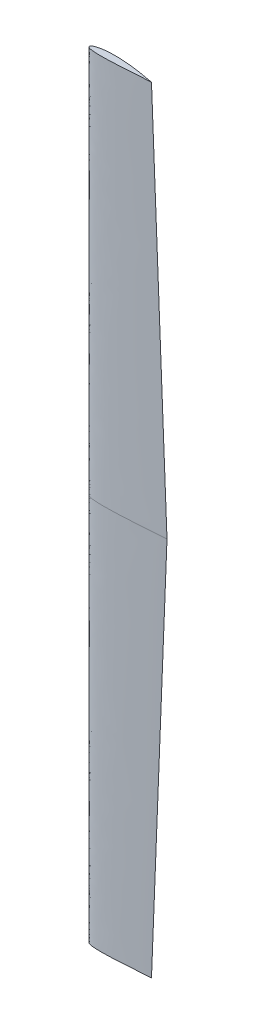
ISO-10303-21;
HEADER;
FILE_DESCRIPTION(('STEP AP214'),'2;1');
FILE_NAME('part.step','',(''),(''),'','','');
FILE_SCHEMA(('AUTOMOTIVE_DESIGN { 1 0 10303 214 1 1 1 1 }'));
ENDSEC;
DATA;
#1=APPLICATION_CONTEXT('core data for automotive mechanical design processes');
#2=APPLICATION_PROTOCOL_DEFINITION('international standard','automotive_design',2000,#1);
#3=PRODUCT_CONTEXT('',#1,'mechanical');
#4=PRODUCT('Part','Part','',(#3));
#5=PRODUCT_RELATED_PRODUCT_CATEGORY('part','',(#4));
#6=PRODUCT_DEFINITION_FORMATION('','',#4);
#7=PRODUCT_DEFINITION_CONTEXT('part definition',#1,'design');
#8=PRODUCT_DEFINITION('design','',#6,#7);
#9=PRODUCT_DEFINITION_SHAPE('','',#8);
#10=(LENGTH_UNIT() NAMED_UNIT(*) SI_UNIT(.MILLI.,.METRE.));
#11=(NAMED_UNIT(*) PLANE_ANGLE_UNIT() SI_UNIT($,.RADIAN.));
#12=(NAMED_UNIT(*) SI_UNIT($,.STERADIAN.) SOLID_ANGLE_UNIT());
#13=UNCERTAINTY_MEASURE_WITH_UNIT(LENGTH_MEASURE(1.E-05),#10,'distance_accuracy_value','');
#14=(GEOMETRIC_REPRESENTATION_CONTEXT(3) GLOBAL_UNCERTAINTY_ASSIGNED_CONTEXT((#13)) GLOBAL_UNIT_ASSIGNED_CONTEXT((#10,
#11,#12)) REPRESENTATION_CONTEXT('',''));
#15=CARTESIAN_POINT('',(0.,0.,0.));
#16=DIRECTION('',(0.,0.,1.));
#17=DIRECTION('',(1.,0.,0.));
#18=AXIS2_PLACEMENT_3D('',#15,#16,#17);
#19=CARTESIAN_POINT('',(124.102672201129,3999.996,27.0117293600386));
#20=DIRECTION('',(0.,-1.,0.));
#21=DIRECTION('',(0.,0.,-1.));
#22=AXIS2_PLACEMENT_3D('',#19,#20,#21);
#23=PLANE('',#22);
#24=CARTESIAN_POINT('',(0.000999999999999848,3999.996,0.));
#25=CARTESIAN_POINT('',(0.0364160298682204,3999.996,0.354641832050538));
#26=CARTESIAN_POINT('',(0.125105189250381,3999.996,0.954374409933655));
#27=CARTESIAN_POINT('',(0.325121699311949,3999.996,1.81732864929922));
#28=CARTESIAN_POINT('',(0.721473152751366,3999.996,2.92630579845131));
#29=CARTESIAN_POINT('',(1.21709625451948,3999.996,3.96600534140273));
#30=CARTESIAN_POINT('',(1.88479299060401,3999.996,5.06190459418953));
#31=CARTESIAN_POINT('',(2.76917850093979,3999.996,6.22842818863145));
#32=CARTESIAN_POINT('',(3.95538112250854,3999.996,7.50188271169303));
#33=CARTESIAN_POINT('',(5.57347370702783,3999.996,8.92251497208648));
#34=CARTESIAN_POINT('',(7.80997137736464,3999.996,10.5221369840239));
#35=CARTESIAN_POINT('',(11.008837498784,3999.996,12.3707639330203));
#36=CARTESIAN_POINT('',(15.6767550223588,3999.996,14.5058856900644));
#37=CARTESIAN_POINT('',(22.2126367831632,3999.996,16.8098966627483));
#38=CARTESIAN_POINT('',(32.4522320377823,3999.996,19.5344758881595));
#39=CARTESIAN_POINT('',(43.9941005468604,3999.996,21.6612155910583));
#40=CARTESIAN_POINT('',(56.1396059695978,3999.996,23.304087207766));
#41=CARTESIAN_POINT('',(70.8646869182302,3999.996,24.775753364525));
#42=CARTESIAN_POINT('',(86.047267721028,3999.996,25.8569639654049));
#43=CARTESIAN_POINT('',(103.803905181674,3999.996,26.647042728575));
#44=CARTESIAN_POINT('',(124.085064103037,3999.996,27.0847907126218));
#45=CARTESIAN_POINT('',(144.408343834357,3999.996,27.1715900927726));
#46=CARTESIAN_POINT('',(164.6689295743,3999.996,26.9954228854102));
#47=CARTESIAN_POINT('',(182.492113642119,3999.996,26.6603872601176));
#48=CARTESIAN_POINT('',(197.611863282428,3999.996,26.2836805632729));
#49=CARTESIAN_POINT('',(210.4555161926,3999.996,25.9092194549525));
#50=CARTESIAN_POINT('',(220.291366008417,3999.996,25.6002578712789));
#51=CARTESIAN_POINT('',(231.016530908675,3999.996,25.2353678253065));
#52=CARTESIAN_POINT('',(240.14160569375,3999.996,24.9132758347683));
#53=CARTESIAN_POINT('',(249.061602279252,3999.996,24.5815006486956));
#54=CARTESIAN_POINT('',(253.686900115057,3999.996,24.4068466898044));
#55=CARTESIAN_POINT('',(256.001000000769,3999.996,24.3186255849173));
#56=B_SPLINE_CURVE_WITH_KNOTS('',4,(#24,#25,#26,#27,#28,#29,#30,#31,#32,#33,#34,#35,#36,#37,#38,
#39,#40,#41,#42,#43,#44,#45,#46,#47,#48,#49,#50,#51,#52,#53,#54,#55),.UNSPECIFIED.,.F.,.F.,(5,1,
1,1,1,1,1,1,1,1,1,1,1,1,1,1,1,1,1,1,1,1,1,1,1,1,1,1,5),(0.,0.00492322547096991,
0.008388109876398,0.0122213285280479,0.0162650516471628,0.0208297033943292,0.0261114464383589,
0.0324383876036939,0.0403017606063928,0.0505689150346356,0.0640920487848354,0.0834735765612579,
0.111216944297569,0.146320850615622,0.210559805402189,0.245663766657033,0.280767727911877,
0.350975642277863,0.421183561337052,0.491391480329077,0.561599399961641,0.631807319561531,
0.702015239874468,0.737119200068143,0.772223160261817,0.807327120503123,0.842431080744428,
0.877535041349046,0.912639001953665),.UNSPECIFIED.);
#57=CARTESIAN_POINT('',(0.000999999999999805,3999.996,0.));
#58=VERTEX_POINT('',#57);
#59=CARTESIAN_POINT('',(256.001047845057,3999.996,24.3198881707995));
#60=VERTEX_POINT('',#59);
#61=EDGE_CURVE('E264',#58,#60,#56,.T.);
#62=ORIENTED_EDGE('',*,*,#61,.T.);
#63=CARTESIAN_POINT('',(256.001000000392,3999.996,24.3186255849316));
#64=CARTESIAN_POINT('',(256.922801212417,3999.996,24.2837684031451));
#65=CARTESIAN_POINT('',(258.661334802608,3999.996,24.2170100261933));
#66=CARTESIAN_POINT('',(263.282007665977,3999.996,24.0377652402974));
#67=CARTESIAN_POINT('',(266.678166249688,3999.996,23.897563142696));
#68=CARTESIAN_POINT('',(271.927535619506,3999.996,23.6809046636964));
#69=CARTESIAN_POINT('',(276.379071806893,3999.996,23.4873511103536));
#70=CARTESIAN_POINT('',(281.221181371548,3999.996,23.2745054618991));
#71=CARTESIAN_POINT('',(285.370712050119,3999.996,23.084698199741));
#72=CARTESIAN_POINT('',(290.073029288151,3999.996,22.867005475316));
#73=CARTESIAN_POINT('',(296.668738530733,3999.996,22.5537511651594));
#74=CARTESIAN_POINT('',(305.805884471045,3999.996,22.1048135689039));
#75=CARTESIAN_POINT('',(317.39238840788,3999.996,21.5091214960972));
#76=CARTESIAN_POINT('',(330.654530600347,3999.996,20.7961626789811));
#77=CARTESIAN_POINT('',(346.744831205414,3999.996,19.8973301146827));
#78=CARTESIAN_POINT('',(366.151653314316,3999.996,18.7675010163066));
#79=CARTESIAN_POINT('',(388.864750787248,3999.996,17.3892615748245));
#80=CARTESIAN_POINT('',(414.88826760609,3999.996,15.7505722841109));
#81=CARTESIAN_POINT('',(441.381942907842,3999.996,14.0341347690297));
#82=CARTESIAN_POINT('',(464.559968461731,3999.996,12.4991243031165));
#83=CARTESIAN_POINT('',(484.429218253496,3999.996,11.1629444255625));
#84=CARTESIAN_POINT('',(500.979627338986,3999.996,10.0372121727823));
#85=CARTESIAN_POINT('',(514.230864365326,3999.996,9.12811994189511));
#86=CARTESIAN_POINT('',(530.768203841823,3999.996,7.98405420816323));
#87=CARTESIAN_POINT('',(547.350368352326,3999.996,6.8228319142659));
#88=CARTESIAN_POINT('',(563.854123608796,3999.996,5.65255275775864));
#89=CARTESIAN_POINT('',(580.47280905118,3999.996,4.45574807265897));
#90=CARTESIAN_POINT('',(593.59057430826,3999.996,3.50032205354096));
#91=CARTESIAN_POINT('',(605.396031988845,3999.996,2.62745572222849));
#92=CARTESIAN_POINT('',(614.960741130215,3999.996,1.91315555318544));
#93=CARTESIAN_POINT('',(623.831106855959,3999.996,1.24143910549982));
#94=CARTESIAN_POINT('',(629.288533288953,3999.996,0.827054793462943));
#95=CARTESIAN_POINT('',(635.903997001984,3999.996,0.31716987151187));
#96=CARTESIAN_POINT('',(638.62145843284,3999.996,0.107067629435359));
#97=CARTESIAN_POINT('',(640.000999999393,3999.996,6.90505416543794E-11));
#98=B_SPLINE_CURVE_WITH_KNOTS('',4,(#63,#64,#65,#66,#67,#68,#69,#70,#71,#72,#73,#74,#75,#76,#77,
#78,#79,#80,#81,#82,#83,#84,#85,#86,#87,#88,#89,#90,#91,#92,#93,#94,#95,#96,#97),.UNSPECIFIED.,
.F.,.F.,(5,1,1,1,1,1,1,1,1,1,1,1,1,1,1,1,1,1,1,1,1,1,1,1,1,1,1,1,1,1,1,5),(0.0827087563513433,
0.0922980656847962,0.101887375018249,0.111476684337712,0.121065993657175,0.132525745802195,
0.143985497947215,0.151177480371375,0.158369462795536,0.172753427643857,0.201521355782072,
0.230289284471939,0.259057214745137,0.287825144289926,0.341251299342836,0.398787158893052,
0.456323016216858,0.513858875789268,0.571394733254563,0.600162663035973,0.628930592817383,
0.657698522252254,0.686466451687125,0.744002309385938,0.772770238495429,0.801538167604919,
0.830306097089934,0.859074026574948,0.873457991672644,0.88784195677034,0.902225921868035,
0.916609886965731),.UNSPECIFIED.);
#99=CARTESIAN_POINT('',(640.000999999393,3999.996,6.90505416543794E-11));
#100=VERTEX_POINT('',#99);
#101=EDGE_CURVE('E327',#60,#100,#98,.T.);
#102=ORIENTED_EDGE('',*,*,#101,.T.);
#103=CARTESIAN_POINT('',(640.0009999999,3999.996,2.71151873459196E-11));
#104=CARTESIAN_POINT('',(639.384420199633,3999.996,-0.13180102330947));
#105=CARTESIAN_POINT('',(638.162405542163,3999.996,-0.392307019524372));
#106=CARTESIAN_POINT('',(635.195177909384,3999.996,-1.02338084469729));
#107=CARTESIAN_POINT('',(632.813522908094,3999.996,-1.52396917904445));
#108=CARTESIAN_POINT('',(629.516545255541,3999.996,-2.21599871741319));
#109=CARTESIAN_POINT('',(626.746430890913,3999.996,-2.79120981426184));
#110=CARTESIAN_POINT('',(623.678928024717,3999.996,-3.42581948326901));
#111=CARTESIAN_POINT('',(620.762255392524,3999.996,-4.02403903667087));
#112=CARTESIAN_POINT('',(615.554015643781,3999.996,-5.0859479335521));
#113=CARTESIAN_POINT('',(608.150635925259,3999.996,-6.57454237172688));
#114=CARTESIAN_POINT('',(598.494034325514,3999.996,-8.47712256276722));
#115=CARTESIAN_POINT('',(586.612015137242,3999.996,-10.7545962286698));
#116=CARTESIAN_POINT('',(574.711215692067,3999.996,-12.9737073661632));
#117=CARTESIAN_POINT('',(562.803753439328,3999.996,-15.1328738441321));
#118=CARTESIAN_POINT('',(550.88343302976,3999.996,-17.234295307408));
#119=CARTESIAN_POINT('',(538.954494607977,3999.996,-19.2778051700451));
#120=CARTESIAN_POINT('',(524.03036178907,3999.996,-21.7610239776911));
#121=CARTESIAN_POINT('',(509.091224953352,3999.996,-24.1496351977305));
#122=CARTESIAN_POINT('',(494.137073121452,3999.996,-26.4444430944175));
#123=CARTESIAN_POINT('',(476.17543530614,3999.996,-29.0854420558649));
#124=CARTESIAN_POINT('',(458.197352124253,3999.996,-31.6133770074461));
#125=CARTESIAN_POINT('',(437.200125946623,3999.996,-34.3962859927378));
#126=CARTESIAN_POINT('',(413.173473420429,3999.996,-37.3435446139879));
#127=CARTESIAN_POINT('',(392.125360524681,3999.996,-39.7115335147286));
#128=CARTESIAN_POINT('',(375.572060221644,3999.996,-41.4279555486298));
#129=CARTESIAN_POINT('',(363.525735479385,3999.996,-42.5998760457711));
#130=CARTESIAN_POINT('',(355.947727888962,3999.996,-43.3087843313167));
#131=CARTESIAN_POINT('',(349.828067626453,3999.996,-43.8636950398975));
#132=CARTESIAN_POINT('',(343.706770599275,3999.996,-44.4007250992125));
#133=CARTESIAN_POINT('',(337.583972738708,3999.996,-44.9195675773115));
#134=CARTESIAN_POINT('',(331.505981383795,3999.996,-45.4163056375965));
#135=CARTESIAN_POINT('',(325.473153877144,3999.996,-45.8910753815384));
#136=CARTESIAN_POINT('',(319.438600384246,3999.996,-46.3473604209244));
#137=CARTESIAN_POINT('',(313.403146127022,3999.996,-46.7847848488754));
#138=CARTESIAN_POINT('',(307.365504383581,3999.996,-47.2030346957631));
#139=CARTESIAN_POINT('',(301.327953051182,3999.996,-47.601645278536));
#140=CARTESIAN_POINT('',(296.04168061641,3999.996,-47.9330274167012));
#141=CARTESIAN_POINT('',(291.513474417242,3999.996,-48.2041797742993));
#142=CARTESIAN_POINT('',(287.733640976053,3999.996,-48.4217185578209));
#143=CARTESIAN_POINT('',(284.719928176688,3999.996,-48.5901199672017));
#144=CARTESIAN_POINT('',(281.684658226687,3999.996,-48.7540183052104));
#145=CARTESIAN_POINT('',(278.687132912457,3999.996,-48.9111412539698));
#146=CARTESIAN_POINT('',(275.624403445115,3999.996,-49.0652719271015));
#147=CARTESIAN_POINT('',(272.670436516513,3999.996,-49.2098547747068));
#148=CARTESIAN_POINT('',(269.534087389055,3999.996,-49.3556953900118));
#149=CARTESIAN_POINT('',(266.70152276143,3999.996,-49.4845808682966));
#150=CARTESIAN_POINT('',(263.35902450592,3999.996,-49.6268214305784));
#151=CARTESIAN_POINT('',(260.881475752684,3999.996,-49.7310253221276));
#152=CARTESIAN_POINT('',(257.901214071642,3999.996,-49.8467033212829));
#153=CARTESIAN_POINT('',(256.631070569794,3999.996,-49.8951050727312));
#154=CARTESIAN_POINT('',(256.001000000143,3999.996,-49.9186255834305));
#155=B_SPLINE_CURVE_WITH_KNOTS('',4,(#103,#104,#105,#106,#107,#108,#109,#110,#111,#112,#113,
#114,#115,#116,#117,#118,#119,#120,#121,#122,#123,#124,#125,#126,#127,#128,#129,#130,#131,#132,
#133,#134,#135,#136,#137,#138,#139,#140,#141,#142,#143,#144,#145,#146,#147,#148,#149,#150,#151,
#152,#153,#154),.UNSPECIFIED.,.F.,.F.,(5,1,1,1,1,1,1,1,1,1,1,1,1,1,1,1,1,1,1,1,1,1,1,1,1,1,1,1,
1,1,1,1,1,1,1,1,1,1,1,1,1,1,1,1,1,1,1,1,5),(0.0831353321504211,0.0896408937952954,
0.0961464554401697,0.102652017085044,0.109157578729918,0.115663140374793,0.122168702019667,
0.128674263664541,0.135179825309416,0.161202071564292,0.187224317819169,0.213246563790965,
0.239268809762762,0.265291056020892,0.291313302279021,0.317335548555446,0.343357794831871,
0.39540228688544,0.421424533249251,0.447446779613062,0.499491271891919,0.551535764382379,
0.603580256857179,0.65562474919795,0.681646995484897,0.69465811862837,0.707669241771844,
0.721081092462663,0.734492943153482,0.747504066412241,0.760515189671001,0.773526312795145,
0.786537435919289,0.799548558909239,0.81255968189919,0.825570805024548,0.838581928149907,
0.84508748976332,0.851593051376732,0.858098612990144,0.864604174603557,0.871109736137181,
0.877615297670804,0.884120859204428,0.890626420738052,0.897131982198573,0.903637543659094,
0.910143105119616,0.916648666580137),.UNSPECIFIED.);
#156=CARTESIAN_POINT('',(256.000953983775,3999.996,-49.9173903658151));
#157=VERTEX_POINT('',#156);
#158=EDGE_CURVE('E189',#100,#157,#155,.T.);
#159=ORIENTED_EDGE('',*,*,#158,.T.);
#160=CARTESIAN_POINT('',(256.000999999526,3999.996,-49.9186255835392));
#161=CARTESIAN_POINT('',(255.438455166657,3999.996,-49.939458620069));
#162=CARTESIAN_POINT('',(254.29870621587,3999.996,-49.9808021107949));
#163=CARTESIAN_POINT('',(252.191979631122,3999.996,-50.0549175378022));
#164=CARTESIAN_POINT('',(249.889510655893,3999.996,-50.1297298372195));
#165=CARTESIAN_POINT('',(247.337173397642,3999.996,-50.2085050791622));
#166=CARTESIAN_POINT('',(244.916183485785,3999.996,-50.2770853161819));
#167=CARTESIAN_POINT('',(242.424507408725,3999.996,-50.3429109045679));
#168=CARTESIAN_POINT('',(239.967863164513,3999.996,-50.4020254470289));
#169=CARTESIAN_POINT('',(235.645056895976,3999.996,-50.496802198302));
#170=CARTESIAN_POINT('',(229.478304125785,3999.996,-50.6043740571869));
#171=CARTESIAN_POINT('',(221.455148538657,3999.996,-50.6897344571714));
#172=CARTESIAN_POINT('',(211.583253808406,3999.996,-50.7018161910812));
#173=CARTESIAN_POINT('',(201.710069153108,3999.996,-50.6177081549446));
#174=CARTESIAN_POINT('',(191.839100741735,3999.996,-50.4336344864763));
#175=CARTESIAN_POINT('',(179.502928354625,3999.996,-50.0735713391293));
#176=CARTESIAN_POINT('',(167.17328112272,3999.996,-49.5327886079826));
#177=CARTESIAN_POINT('',(154.853310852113,3999.996,-48.7989766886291));
#178=CARTESIAN_POINT('',(140.086885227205,3999.996,-47.6685519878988));
#179=CARTESIAN_POINT('',(125.342408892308,3999.996,-46.2741203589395));
#180=CARTESIAN_POINT('',(108.183685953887,3999.996,-44.2281564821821));
#181=CARTESIAN_POINT('',(88.6627598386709,3999.996,-41.2295240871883));
#182=CARTESIAN_POINT('',(69.2756694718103,3999.996,-37.4494779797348));
#183=CARTESIAN_POINT('',(51.4506535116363,3999.996,-33.0316465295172));
#184=CARTESIAN_POINT('',(36.2840391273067,3999.996,-28.2580680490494));
#185=CARTESIAN_POINT('',(24.4644419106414,3999.996,-23.5257091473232));
#186=CARTESIAN_POINT('',(16.3564477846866,3999.996,-19.4685255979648));
#187=CARTESIAN_POINT('',(10.8794730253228,3999.996,-16.0797330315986));
#188=CARTESIAN_POINT('',(7.17212908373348,3999.996,-13.251282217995));
#189=CARTESIAN_POINT('',(4.6710591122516,3999.996,-10.8978568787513));
#190=CARTESIAN_POINT('',(2.97749643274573,3999.996,-8.92435230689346));
#191=CARTESIAN_POINT('',(1.82167657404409,3999.996,-7.23589052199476));
#192=CARTESIAN_POINT('',(1.03378024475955,3999.996,-5.75926809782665));
#193=CARTESIAN_POINT('',(0.503847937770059,3999.996,-4.43224816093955));
#194=CARTESIAN_POINT('',(0.169066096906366,3999.996,-3.22138370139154));
#195=CARTESIAN_POINT('',(-0.0336387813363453,3999.996,-1.97051336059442));
#196=CARTESIAN_POINT('',(-0.0688058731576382,3999.996,-1.02386885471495));
#197=CARTESIAN_POINT('',(-0.0368151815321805,3999.996,-0.377479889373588));
#198=CARTESIAN_POINT('',(0.000999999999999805,3999.996,0.));
#199=B_SPLINE_CURVE_WITH_KNOTS('',4,(#160,#161,#162,#163,#164,#165,#166,#167,#168,#169,#170,
#171,#172,#173,#174,#175,#176,#177,#178,#179,#180,#181,#182,#183,#184,#185,#186,#187,#188,#189,
#190,#191,#192,#193,#194,#195,#196,#197,#198),.UNSPECIFIED.,.F.,.F.,(5,1,1,1,1,1,1,1,1,1,1,1,1,
1,1,1,1,1,1,1,1,1,1,1,1,1,1,1,1,1,1,1,1,1,1,5),(0.,0.00832932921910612,0.0166586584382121,
0.0249879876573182,0.0333173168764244,0.0416466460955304,0.0499759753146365,0.0583053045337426,
0.0666346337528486,0.0999519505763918,0.133269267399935,0.166586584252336,0.199903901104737,
0.233221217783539,0.266538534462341,0.333173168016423,0.36649048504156,0.399807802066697,
0.466442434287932,0.533077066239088,0.599711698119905,0.666346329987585,0.732980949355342,
0.780839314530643,0.814156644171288,0.83803006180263,0.855218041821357,0.86765330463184,
0.876997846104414,0.884304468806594,0.890255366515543,0.895219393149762,0.899544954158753,
0.903554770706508,0.907179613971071,0.912291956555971),.UNSPECIFIED.);
#200=EDGE_CURVE('E12',#157,#58,#199,.T.);
#201=ORIENTED_EDGE('',*,*,#200,.T.);
#202=EDGE_LOOP('',(#62,#102,#159,#201));
#203=FACE_BOUND('',#202,.T.);
#204=ADVANCED_FACE('F179',(#203),#23,.F.);
#205=CARTESIAN_POINT('',(0.,0.,0.));
#206=CARTESIAN_POINT('',(0.000999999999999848,3999.996,0.));
#207=CARTESIAN_POINT('',(0.0853562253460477,0.,0.854722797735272));
#208=CARTESIAN_POINT('',(0.0692849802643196,3999.996,0.683778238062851));
#209=CARTESIAN_POINT('',(0.433238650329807,0.,2.54654439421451));
#210=CARTESIAN_POINT('',(0.347592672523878,3999.996,2.03723490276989));
#211=CARTESIAN_POINT('',(1.45315835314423,0.,4.92608255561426));
#212=CARTESIAN_POINT('',(1.16352335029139,3999.99600000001,3.940866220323));
#213=CARTESIAN_POINT('',(2.87203291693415,0.,7.08689813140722));
#214=CARTESIAN_POINT('',(2.29863184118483,3999.99599999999,5.66951685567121));
#215=CARTESIAN_POINT('',(4.58293537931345,0.,9.02097921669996));
#216=CARTESIAN_POINT('',(3.66733650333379,3999.996,7.21678463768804));
#217=CARTESIAN_POINT('',(6.49902012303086,0.,10.7485302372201));
#218=CARTESIAN_POINT('',(5.2002344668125,3999.996,8.59882090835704));
#219=CARTESIAN_POINT('',(9.25037064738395,0.,12.8123050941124));
#220=CARTESIAN_POINT('',(7.40124111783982,3999.996,10.2498615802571));
#221=CARTESIAN_POINT('',(12.946176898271,0.,15.0145710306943));
#222=CARTESIAN_POINT('',(10.3580070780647,3999.996,12.011639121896));
#223=CARTESIAN_POINT('',(17.607847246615,0.,17.2211195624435));
#224=CARTESIAN_POINT('',(14.0872847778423,3999.99599999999,13.776909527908));
#225=CARTESIAN_POINT('',(22.4084836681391,0.,19.1028639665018));
#226=CARTESIAN_POINT('',(17.9278106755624,3999.99600000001,15.2822948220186));
#227=CARTESIAN_POINT('',(27.2989388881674,0.,20.7331952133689));
#228=CARTESIAN_POINT('',(21.840166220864,3999.99599999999,16.5865643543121));
#229=CARTESIAN_POINT('',(32.251504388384,0.,22.1627695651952));
#230=CARTESIAN_POINT('',(25.8022263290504,3999.996,17.7302204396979));
#231=CARTESIAN_POINT('',(37.2480749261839,0.,23.4284095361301));
#232=CARTESIAN_POINT('',(29.7994793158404,3999.996,18.7427346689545));
#233=CARTESIAN_POINT('',(42.2773180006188,0.,24.5567845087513));
#234=CARTESIAN_POINT('',(33.8228763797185,3999.996,19.6454270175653));
#235=CARTESIAN_POINT('',(47.3311018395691,0.,25.5688364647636));
#236=CARTESIAN_POINT('',(37.8658979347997,3999.996,20.4550838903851));
#237=CARTESIAN_POINT('',(52.4041531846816,0.,26.4791757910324));
#238=CARTESIAN_POINT('',(41.9243473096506,3999.996,21.1833311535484));
#239=CARTESIAN_POINT('',(57.4922205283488,0.,27.3009729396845));
#240=CARTESIAN_POINT('',(45.9947882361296,3999.996,21.8408062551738));
#241=CARTESIAN_POINT('',(62.5922363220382,0.,28.0448974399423));
#242=CARTESIAN_POINT('',(50.0748186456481,3999.996,22.435874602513));
#243=CARTESIAN_POINT('',(67.7018005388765,0.,28.7197404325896));
#244=CARTESIAN_POINT('',(54.1624457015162,3999.996,22.9758439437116));
#245=CARTESIAN_POINT('',(74.5250920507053,0.,29.5359456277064));
#246=CARTESIAN_POINT('',(59.621101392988,3999.99600000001,23.628720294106));
#247=CARTESIAN_POINT('',(83.0702999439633,0.,30.4137326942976));
#248=CARTESIAN_POINT('',(66.457252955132,3999.996,24.3310028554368));
#249=CARTESIAN_POINT('',(93.3418895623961,0.,31.2798351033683));
#250=CARTESIAN_POINT('',(74.6745327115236,3999.99600000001,25.0238642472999));
#251=CARTESIAN_POINT('',(103.625579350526,0.,31.9866845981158));
#252=CARTESIAN_POINT('',(82.9014794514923,3999.996,25.5893518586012));
#253=CARTESIAN_POINT('',(113.91773838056,0.,32.5558223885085));
#254=CARTESIAN_POINT('',(91.1352081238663,3999.996,26.044656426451));
#255=CARTESIAN_POINT('',(124.215745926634,0.,33.0058540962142));
#256=CARTESIAN_POINT('',(99.3736116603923,3999.996,26.4046861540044));
#257=CARTESIAN_POINT('',(134.517752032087,0.,33.351468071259));
#258=CARTESIAN_POINT('',(107.615217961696,3999.996,26.6811751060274));
#259=CARTESIAN_POINT('',(144.8224069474,0.,33.6051449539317));
#260=CARTESIAN_POINT('',(115.858940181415,3999.996,26.8841158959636));
#261=CARTESIAN_POINT('',(155.128736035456,0.,33.7768511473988));
#262=CARTESIAN_POINT('',(124.104002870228,3999.996,27.0214815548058));
#263=CARTESIAN_POINT('',(165.436005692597,0.,33.8755514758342));
#264=CARTESIAN_POINT('',(132.349817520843,3999.996,27.1004405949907));
#265=CARTESIAN_POINT('',(175.743681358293,0.,33.9093408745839));
#266=CARTESIAN_POINT('',(140.595957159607,3999.996,27.127473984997));
#267=CARTESIAN_POINT('',(186.051375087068,0.,33.8853128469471));
#268=CARTESIAN_POINT('',(148.842111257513,3999.996,27.1082476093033));
#269=CARTESIAN_POINT('',(196.358809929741,0.,33.8092235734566));
#270=CARTESIAN_POINT('',(157.08805849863,3999.996,27.0473845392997));
#271=CARTESIAN_POINT('',(206.665786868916,0.,33.6864276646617));
#272=CARTESIAN_POINT('',(165.333639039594,3999.996,26.9491331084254));
#273=CARTESIAN_POINT('',(220.407634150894,0.,33.4664440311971));
#274=CARTESIAN_POINT('',(176.327115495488,3999.996,26.7731691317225));
#275=CARTESIAN_POINT('',(237.58329358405,0.,33.1001026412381));
#276=CARTESIAN_POINT('',(190.067642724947,3999.996,26.4800951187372));
#277=CARTESIAN_POINT('',(258.191150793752,0.,32.5411511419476));
#278=CARTESIAN_POINT('',(206.553926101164,3999.996,26.032911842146));
#279=CARTESIAN_POINT('',(278.796326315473,0.,31.8917776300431));
#280=CARTESIAN_POINT('',(223.038064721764,3999.996,25.5134269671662));
#281=CARTESIAN_POINT('',(299.399176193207,0.,31.172639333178));
#282=CARTESIAN_POINT('',(239.520343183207,3999.996,24.9381087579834));
#283=CARTESIAN_POINT('',(313.133194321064,0.,30.6600672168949));
#284=CARTESIAN_POINT('',(250.507555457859,3999.996,24.5280537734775));
#285=CARTESIAN_POINT('',(340.026668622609,0.,29.6409893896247));
#286=CARTESIAN_POINT('',(272.022334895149,3999.996,23.7127915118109));
#287=CARTESIAN_POINT('',(380.068448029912,0.,27.829705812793));
#288=CARTESIAN_POINT('',(304.055758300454,3999.996,22.2637916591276));
#289=CARTESIAN_POINT('',(440.101589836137,0.,24.5383542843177));
#290=CARTESIAN_POINT('',(352.082271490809,3999.99600000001,19.6306604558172));
#291=CARTESIAN_POINT('',(500.113576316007,0.,20.8841421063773));
#292=CARTESIAN_POINT('',(400.091861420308,3999.99599999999,16.7073264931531));
#293=CARTESIAN_POINT('',(560.111385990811,0.,17.0064464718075));
#294=CARTESIAN_POINT('',(448.090108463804,3999.99600000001,13.6051501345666));
#295=CARTESIAN_POINT('',(620.09955436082,0.,12.9823833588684));
#296=CARTESIAN_POINT('',(496.080643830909,3999.99599999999,10.3859085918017));
#297=CARTESIAN_POINT('',(680.079453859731,0.,8.83707223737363));
#298=CARTESIAN_POINT('',(544.064562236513,3999.996,7.06964550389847));
#299=CARTESIAN_POINT('',(740.049297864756,0.,4.54836949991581));
#300=CARTESIAN_POINT('',(592.040439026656,3999.996,3.63870603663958));
#301=CARTESIAN_POINT('',(780.01910510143,0.,1.55073765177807));
#302=CARTESIAN_POINT('',(624.016284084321,3999.996,1.24059012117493));
#303=CARTESIAN_POINT('',(799.999999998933,0.,1.12448292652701E-10));
#304=CARTESIAN_POINT('',(640.000999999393,3999.996,6.90505416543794E-11));
#305=B_SPLINE_SURFACE_WITH_KNOTS('',3,1,((#205,#206),(#207,#208),(#209,#210),(#211,#212),(#213,
#214),(#215,#216),(#217,#218),(#219,#220),(#221,#222),(#223,#224),(#225,#226),(#227,#228),(#229,
#230),(#231,#232),(#233,#234),(#235,#236),(#237,#238),(#239,#240),(#241,#242),(#243,#244),(#245,
#246),(#247,#248),(#249,#250),(#251,#252),(#253,#254),(#255,#256),(#257,#258),(#259,#260),(#261,
#262),(#263,#264),(#265,#266),(#267,#268),(#269,#270),(#271,#272),(#273,#274),(#275,#276),(#277,
#278),(#279,#280),(#281,#282),(#283,#284),(#285,#286),(#287,#288),(#289,#290),(#291,#292),(#293,
#294),(#295,#296),(#297,#298),(#299,#300),(#301,#302),(#303,#304)),.UNSPECIFIED.,.F.,.F.,.F.,(4,
1,1,1,1,1,1,1,1,1,1,1,1,1,1,1,1,1,1,1,1,1,1,1,1,1,1,1,1,1,1,1,1,1,1,1,1,1,2,1,1,1,1,1,1,1,4),(2,
2),(0.,0.00317818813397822,0.00635637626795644,0.00953456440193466,0.0127127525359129,
0.0158909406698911,0.0190691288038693,0.0254255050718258,0.0317818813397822,0.0381382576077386,
0.0444946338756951,0.0508510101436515,0.0572073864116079,0.0635637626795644,0.0699201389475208,
0.0762765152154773,0.0826328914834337,0.0889892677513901,0.0953456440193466,0.101702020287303,
0.114414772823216,0.127127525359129,0.139840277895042,0.152553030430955,0.165265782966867,
0.17797853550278,0.190691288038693,0.203404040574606,0.216116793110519,0.228829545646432,
0.241542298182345,0.254255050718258,0.26696780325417,0.279680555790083,0.305106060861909,
0.330531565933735,0.355957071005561,0.381382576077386,0.406808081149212,0.48095707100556,
0.555106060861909,0.629255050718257,0.703404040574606,0.777553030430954,0.851702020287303,
0.925851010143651,1.),(0.,1.),.UNSPECIFIED.);
#306=CARTESIAN_POINT('',(0.,0.,0.));
#307=CARTESIAN_POINT('',(0.0442700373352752,0.,0.443302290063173));
#308=CARTESIAN_POINT('',(0.155131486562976,0.,1.19296801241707));
#309=CARTESIAN_POINT('',(0.405152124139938,0.,2.27166081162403));
#310=CARTESIAN_POINT('',(0.900591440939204,0.,3.65788224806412));
#311=CARTESIAN_POINT('',(1.52012031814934,0.,4.95750667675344));
#312=CARTESIAN_POINT('',(2.35474123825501,0.,6.32738074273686));
#313=CARTESIAN_POINT('',(3.4602231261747,0.,7.78553523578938));
#314=CARTESIAN_POINT('',(4.94297640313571,0.,9.37735338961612));
#315=CARTESIAN_POINT('',(6.96559213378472,0.,11.1531437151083));
#316=CARTESIAN_POINT('',(9.76121422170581,0.,13.1526712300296));
#317=CARTESIAN_POINT('',(13.75979687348,0.,15.4634549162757));
#318=CARTESIAN_POINT('',(19.5946937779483,0.,18.1323571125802));
#319=CARTESIAN_POINT('',(27.7645459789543,0.,21.0123708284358));
#320=CARTESIAN_POINT('',(40.564040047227,0.,24.418094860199));
#321=CARTESIAN_POINT('',(54.9913756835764,0.,27.0765194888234));
#322=CARTESIAN_POINT('',(70.1732574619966,0.,29.1301090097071));
#323=CARTESIAN_POINT('',(88.5796086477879,0.,30.9696917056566));
#324=CARTESIAN_POINT('',(107.557834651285,0.,32.3212049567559));
#325=CARTESIAN_POINT('',(129.753631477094,0.,33.3088034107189));
#326=CARTESIAN_POINT('',(155.105080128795,0.,33.8559883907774));
#327=CARTESIAN_POINT('',(180.509179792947,0.,33.9644876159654));
#328=CARTESIAN_POINT('',(205.834911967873,0.,33.7442786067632));
#329=CARTESIAN_POINT('',(228.11389205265,0.,33.3254840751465));
#330=CARTESIAN_POINT('',(247.013579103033,0.,32.8546007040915));
#331=CARTESIAN_POINT('',(263.068145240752,0.,32.3865243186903));
#332=CARTESIAN_POINT('',(275.362957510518,0.,32.0003223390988));
#333=CARTESIAN_POINT('',(288.769413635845,0.,31.5442097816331));
#334=CARTESIAN_POINT('',(300.175757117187,0.,31.1415947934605));
#335=CARTESIAN_POINT('',(311.325752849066,0.,30.7268758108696));
#336=CARTESIAN_POINT('',(317.107375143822,0.,30.5085583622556));
#337=CARTESIAN_POINT('',(320.000000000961,0.,30.3982819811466));
#338=B_SPLINE_CURVE_WITH_KNOTS('',4,(#306,#307,#308,#309,#310,#311,#312,#313,#314,#315,#316,
#317,#318,#319,#320,#321,#322,#323,#324,#325,#326,#327,#328,#329,#330,#331,#332,#333,#334,#335,
#336,#337),.UNSPECIFIED.,.F.,.F.,(5,1,1,1,1,1,1,1,1,1,1,1,1,1,1,1,1,1,1,1,1,1,1,1,1,1,1,1,5),
(0.,0.00492322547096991,0.00838810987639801,0.0122213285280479,0.0162650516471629,
0.0208297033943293,0.0261114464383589,0.0324383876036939,0.0403017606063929,0.0505689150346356,
0.0640920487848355,0.083473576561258,0.111216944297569,0.146320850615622,0.210559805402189,
0.245663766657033,0.280767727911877,0.350975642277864,0.421183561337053,0.491391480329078,
0.561599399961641,0.631807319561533,0.702015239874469,0.737119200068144,0.772223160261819,
0.807327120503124,0.842431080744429,0.877535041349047,0.912639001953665),.UNSPECIFIED.);
#339=CARTESIAN_POINT('',(0.,0.,0.));
#340=VERTEX_POINT('',#339);
#341=CARTESIAN_POINT('',(320.000059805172,0.,30.3998602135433));
#342=VERTEX_POINT('',#341);
#343=EDGE_CURVE('E249',#340,#342,#338,.T.);
#344=CARTESIAN_POINT('',(320.000000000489,0.,30.3982819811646));
#345=CARTESIAN_POINT('',(321.152251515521,0.,30.3547105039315));
#346=CARTESIAN_POINT('',(323.325418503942,0.,30.2712625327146));
#347=CARTESIAN_POINT('',(329.101259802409,0.,30.0472065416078));
#348=CARTESIAN_POINT('',(333.346457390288,0.,29.8719539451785));
#349=CARTESIAN_POINT('',(339.908170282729,0.,29.6011307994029));
#350=CARTESIAN_POINT('',(345.472588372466,0.,29.3591889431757));
#351=CARTESIAN_POINT('',(351.525229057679,0.,29.0931317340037));
#352=CARTESIAN_POINT('',(356.712136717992,0.,28.8558728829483));
#353=CARTESIAN_POINT('',(362.590041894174,0.,28.5837566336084));
#354=CARTESIAN_POINT('',(370.834662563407,0.,28.1921893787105));
#355=CARTESIAN_POINT('',(382.256123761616,0.,27.6310162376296));
#356=CARTESIAN_POINT('',(396.739209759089,0.,26.8864028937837));
#357=CARTESIAN_POINT('',(413.316946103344,0.,25.9952020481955));
#358=CARTESIAN_POINT('',(433.429733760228,0.,24.8716648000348));
#359=CARTESIAN_POINT('',(457.688426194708,0.,23.4593721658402));
#360=CARTESIAN_POINT('',(486.07952035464,0.,21.7365822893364));
#361=CARTESIAN_POINT('',(514.4691139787,0.,19.9489153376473));
#362=CARTESIAN_POINT('',(539.307380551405,0.,18.3472292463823));
#363=CARTESIAN_POINT('',(564.142040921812,0.,16.7204263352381));
#364=CARTESIAN_POINT('',(584.841373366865,0.,15.3452713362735));
#365=CARTESIAN_POINT('',(605.529012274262,0.,13.9541746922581));
#366=CARTESIAN_POINT('',(626.232541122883,0.,12.5457923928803));
#367=CARTESIAN_POINT('',(642.770329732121,0.,11.4114718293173));
#368=CARTESIAN_POINT('',(663.492121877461,0.,9.97749574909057));
#369=CARTESIAN_POINT('',(688.262857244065,0.,8.24362170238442));
#370=CARTESIAN_POINT('',(713.189327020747,0.,6.46926264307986));
#371=CARTESIAN_POINT('',(737.868290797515,0.,4.67956897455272));
#372=CARTESIAN_POINT('',(756.694693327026,0.,3.28813006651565));
#373=CARTESIAN_POINT('',(768.729362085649,0.,2.38914053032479));
#374=CARTESIAN_POINT('',(779.77116986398,0.,1.55307663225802));
#375=CARTESIAN_POINT('',(786.618328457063,0.,1.03312684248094));
#376=CARTESIAN_POINT('',(794.879372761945,0.,0.396413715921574));
#377=CARTESIAN_POINT('',(798.275573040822,0.,0.133834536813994));
#378=CARTESIAN_POINT('',(799.999999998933,0.,1.12448292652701E-10));
#379=B_SPLINE_CURVE_WITH_KNOTS('',4,(#344,#345,#346,#347,#348,#349,#350,#351,#352,#353,#354,
#355,#356,#357,#358,#359,#360,#361,#362,#363,#364,#365,#366,#367,#368,#369,#370,#371,#372,#373,
#374,#375,#376,#377,#378),.UNSPECIFIED.,.F.,.F.,(5,1,1,1,1,1,1,1,1,1,1,1,1,1,1,1,1,1,1,1,1,1,1,
1,1,1,1,1,1,1,1,5),(0.0827087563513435,0.0922980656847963,0.101887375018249,0.111476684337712,
0.121065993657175,0.132525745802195,0.143985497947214,0.151177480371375,0.158369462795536,
0.172753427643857,0.201521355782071,0.230289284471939,0.259057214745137,0.287825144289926,
0.341251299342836,0.398787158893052,0.456323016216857,0.485090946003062,0.513858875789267,
0.571394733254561,0.600162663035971,0.628930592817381,0.657698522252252,0.686466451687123,
0.744002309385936,0.801538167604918,0.830306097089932,0.859074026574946,0.873457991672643,
0.887841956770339,0.902225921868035,0.916609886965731),.UNSPECIFIED.);
#380=CARTESIAN_POINT('',(799.999999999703,0.,4.20201928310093E-11));
#381=VERTEX_POINT('',#380);
#382=EDGE_CURVE('E255',#342,#381,#379,.T.);
#383=DIRECTION('',(-0.0399678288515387,0.999200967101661,0.));
#384=VECTOR('',#383,1.);
#385=CARTESIAN_POINT('',(720.000499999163,1999.998,9.07494171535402E-11));
#386=LINE('',#385,#384);
#387=EDGE_CURVE('E266',#381,#100,#386,.T.);
#388=DIRECTION('',(-2.50000250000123E-07,-0.999999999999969,0.));
#389=VECTOR('',#388,1.);
#390=CARTESIAN_POINT('',(0.000500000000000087,1999.998,0.));
#391=LINE('',#390,#389);
#392=EDGE_CURVE('E262',#58,#340,#391,.T.);
#393=ORIENTED_EDGE('',*,*,#343,.T.);
#394=ORIENTED_EDGE('',*,*,#382,.T.);
#395=ORIENTED_EDGE('',*,*,#387,.T.);
#396=ORIENTED_EDGE('',*,*,#101,.F.);
#397=ORIENTED_EDGE('',*,*,#61,.F.);
#398=ORIENTED_EDGE('',*,*,#392,.T.);
#399=EDGE_LOOP('',(#393,#394,#395,#396,#397,#398));
#400=FACE_BOUND('',#399,.T.);
#401=ADVANCED_FACE('F263',(#400),#305,.T.);
#402=CARTESIAN_POINT('',(799.999999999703,0.,4.20201928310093E-11));
#403=CARTESIAN_POINT('',(640.0009999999,3999.996,2.71151873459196E-11));
#404=CARTESIAN_POINT('',(780.254721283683,0.,-4.22078040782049));
#405=CARTESIAN_POINT('',(624.204777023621,3999.996,-3.37662432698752));
#406=CARTESIAN_POINT('',(740.671010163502,0.,-12.2256101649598));
#407=CARTESIAN_POINT('',(592.537808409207,3999.996,-9.78048911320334));
#408=CARTESIAN_POINT('',(681.064370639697,0.,-23.0246424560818));
#409=CARTESIAN_POINT('',(544.852500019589,3999.996,-18.4197129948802));
#410=CARTESIAN_POINT('',(621.26170475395,0.,-32.6779247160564));
#411=CARTESIAN_POINT('',(497.010365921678,3999.99599999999,-26.1423481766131));
#412=CARTESIAN_POINT('',(561.288229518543,0.,-41.2060120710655));
#413=CARTESIAN_POINT('',(449.031586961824,3999.99600000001,-32.9648011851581));
#414=CARTESIAN_POINT('',(501.162059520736,0.,-48.582470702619));
#415=CARTESIAN_POINT('',(400.930647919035,3999.996,-38.8659874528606));
#416=CARTESIAN_POINT('',(440.897200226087,0.,-54.7298373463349));
#417=CARTESIAN_POINT('',(352.71876545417,3999.99600000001,-43.7838671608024));
#418=CARTESIAN_POINT('',(380.507692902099,0.,-59.5096559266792));
#419=CARTESIAN_POINT('',(304.407152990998,3999.99599999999,-47.6077330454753));
#420=CARTESIAN_POINT('',(340.177306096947,0.,-61.6450639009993));
#421=CARTESIAN_POINT('',(272.142844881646,3999.996,-49.3160511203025));
#422=CARTESIAN_POINT('',(312.964808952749,0.,-62.6588201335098));
#423=CARTESIAN_POINT('',(250.372847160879,3999.996,-50.127056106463));
#424=CARTESIAN_POINT('',(298.890676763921,0.,-63.0786953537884));
#425=CARTESIAN_POINT('',(239.113542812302,3999.99599999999,-50.4629540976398));
#426=CARTESIAN_POINT('',(277.772273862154,0.,-63.3884516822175));
#427=CARTESIAN_POINT('',(222.218820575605,3999.99600000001,-50.7107619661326));
#428=CARTESIAN_POINT('',(256.65154782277,0.,-63.3592786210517));
#429=CARTESIAN_POINT('',(205.322241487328,3999.99599999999,-50.6874241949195));
#430=CARTESIAN_POINT('',(235.534289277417,0.,-62.9694719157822));
#431=CARTESIAN_POINT('',(188.428437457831,3999.99600000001,-50.3755749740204));
#432=CARTESIAN_POINT('',(214.427569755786,0.,-62.1937019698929));
#433=CARTESIAN_POINT('',(171.543064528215,3999.99599999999,-49.7549652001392));
#434=CARTESIAN_POINT('',(196.854647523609,0.,-61.2007216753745));
#435=CARTESIAN_POINT('',(157.484726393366,3999.99600000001,-48.9605744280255));
#436=CARTESIAN_POINT('',(182.811412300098,0.,-60.1804210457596));
#437=CARTESIAN_POINT('',(146.250140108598,3999.99599999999,-48.14434272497));
#438=CARTESIAN_POINT('',(172.288261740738,0.,-59.2968231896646));
#439=CARTESIAN_POINT('',(137.831620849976,3999.99600000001,-47.4374550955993));
#440=CARTESIAN_POINT('',(161.776246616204,0.,-58.2890509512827));
#441=CARTESIAN_POINT('',(129.42200914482,3999.996,-46.6312429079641));
#442=CARTESIAN_POINT('',(151.27756769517,0.,-57.1505573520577));
#443=CARTESIAN_POINT('',(121.023067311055,3999.996,-45.7204481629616));
#444=CARTESIAN_POINT('',(140.794773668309,0.,-55.8737968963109));
#445=CARTESIAN_POINT('',(112.636833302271,3999.996,-44.6990398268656));
#446=CARTESIAN_POINT('',(130.330875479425,0.,-54.4502123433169));
#447=CARTESIAN_POINT('',(104.265716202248,3999.99600000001,-43.5601709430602));
#448=CARTESIAN_POINT('',(119.889488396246,0.,-52.8696718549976));
#449=CARTESIAN_POINT('',(95.912607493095,3999.996,-42.295740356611));
#450=CARTESIAN_POINT('',(109.474930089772,0.,-51.120733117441));
#451=CARTESIAN_POINT('',(87.5809621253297,3999.996,-40.8965894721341));
#452=CARTESIAN_POINT('',(99.0926310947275,0.,-49.1891188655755));
#453=CARTESIAN_POINT('',(79.2751237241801,3999.996,-39.3513003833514));
#454=CARTESIAN_POINT('',(88.7493541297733,0.,-47.057914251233));
#455=CARTESIAN_POINT('',(71.0005040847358,3999.996,-37.6463332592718));
#456=CARTESIAN_POINT('',(78.4539529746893,0.,-44.7057177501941));
#457=CARTESIAN_POINT('',(62.7641834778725,3999.996,-35.7645826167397));
#458=CARTESIAN_POINT('',(69.9241221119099,0.,-42.5388812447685));
#459=CARTESIAN_POINT('',(55.9403167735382,3999.99600000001,-34.0311122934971));
#460=CARTESIAN_POINT('',(63.1380759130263,0.,-40.6642432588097));
#461=CARTESIAN_POINT('',(50.5114818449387,3999.996,-32.5313973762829));
#462=CARTESIAN_POINT('',(58.0703892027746,0.,-39.1814480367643));
#463=CARTESIAN_POINT('',(46.4573314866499,3999.996,-31.3451666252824));
#464=CARTESIAN_POINT('',(53.0277849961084,0.,-37.615308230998));
#465=CARTESIAN_POINT('',(42.4232491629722,3999.99600000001,-30.0922529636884));
#466=CARTESIAN_POINT('',(48.0143752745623,0.,-35.9579916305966));
#467=CARTESIAN_POINT('',(38.4125224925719,3999.99599999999,-28.7664004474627));
#468=CARTESIAN_POINT('',(43.0350914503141,0.,-34.2006191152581));
#469=CARTESIAN_POINT('',(34.4290921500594,3999.99600000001,-27.3604994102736));
#470=CARTESIAN_POINT('',(38.0966761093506,0.,-32.3312520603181));
#471=CARTESIAN_POINT('',(30.4783593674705,3999.99599999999,-25.8650097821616));
#472=CARTESIAN_POINT('',(33.2081894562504,0.,-30.3345800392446));
#473=CARTESIAN_POINT('',(26.5675714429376,3999.99600000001,-24.267673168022));
#474=CARTESIAN_POINT('',(28.3812244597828,0.,-28.1931304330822));
#475=CARTESIAN_POINT('',(22.7059981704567,3999.99599999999,-22.554510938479));
#476=CARTESIAN_POINT('',(23.632839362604,0.,-25.8817554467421));
#477=CARTESIAN_POINT('',(18.9072928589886,3999.99600000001,-20.7054197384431));
#478=CARTESIAN_POINT('',(18.9878985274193,0.,-23.368280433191));
#479=CARTESIAN_POINT('',(15.1913361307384,3999.996,-18.6946260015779));
#480=CARTESIAN_POINT('',(14.4839932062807,0.,-20.6076408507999));
#481=CARTESIAN_POINT('',(11.5882172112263,3999.99599999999,-16.4861424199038));
#482=CARTESIAN_POINT('',(10.1848041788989,0.,-17.5355998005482));
#483=CARTESIAN_POINT('',(8.14883910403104,3999.99600000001,-14.0284904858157));
#484=CARTESIAN_POINT('',(6.86341002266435,0.,-14.6379600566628));
#485=CARTESIAN_POINT('',(5.49168109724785,3999.99599999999,-11.7103797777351));
#486=CARTESIAN_POINT('',(4.47235982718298,0.,-12.0497187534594));
#487=CARTESIAN_POINT('',(3.57891993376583,3999.996,-9.63977518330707));
#488=CARTESIAN_POINT('',(2.8632521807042,0.,-9.95288685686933));
#489=CARTESIAN_POINT('',(2.29159223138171,3999.996,-7.96231809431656));
#490=CARTESIAN_POINT('',(1.50297700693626,0.,-7.68374659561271));
#491=CARTESIAN_POINT('',(1.2033871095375,3999.996,-6.1470010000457));
#492=CARTESIAN_POINT('',(0.485836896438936,0.,-5.23820620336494));
#493=CARTESIAN_POINT('',(0.389679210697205,3999.996,-4.19057497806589));
#494=CARTESIAN_POINT('',(-0.0769217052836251,0.,-2.64558703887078));
#495=CARTESIAN_POINT('',(-0.0605651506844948,3999.996,-2.11647234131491));
#496=CARTESIAN_POINT('',(-0.0877177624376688,0.,-0.875618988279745));
#497=CARTESIAN_POINT('',(-0.0691742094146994,3999.996,-0.700495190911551));
#498=CARTESIAN_POINT('',(0.,0.,0.));
#499=CARTESIAN_POINT('',(0.000999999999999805,3999.996,0.));
#500=B_SPLINE_SURFACE_WITH_KNOTS('',3,1,((#402,#403),(#404,#405),(#406,#407),(#408,#409),(#410,
#411),(#412,#413),(#414,#415),(#416,#417),(#418,#419),(#420,#421),(#422,#423),(#424,#425),(#426,
#427),(#428,#429),(#430,#431),(#432,#433),(#434,#435),(#436,#437),(#438,#439),(#440,#441),(#442,
#443),(#444,#445),(#446,#447),(#448,#449),(#450,#451),(#452,#453),(#454,#455),(#456,#457),(#458,
#459),(#460,#461),(#462,#463),(#464,#465),(#466,#467),(#468,#469),(#470,#471),(#472,#473),(#474,
#475),(#476,#477),(#478,#479),(#480,#481),(#482,#483),(#484,#485),(#486,#487),(#488,#489),(#490,
#491),(#492,#493),(#494,#495),(#496,#497),(#498,#499)),.UNSPECIFIED.,.F.,.F.,.F.,(4,1,1,1,1,1,1,
1,2,1,1,1,1,1,1,1,1,1,1,1,1,1,1,1,1,1,1,1,1,1,1,1,1,1,1,1,1,1,1,1,1,1,1,1,1,4),(2,2),(0.,
0.0736448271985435,0.147289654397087,0.220934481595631,0.294579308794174,0.368224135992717,
0.441868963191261,0.515513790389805,0.589158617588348,0.614836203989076,0.640513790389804,
0.666191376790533,0.691868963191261,0.717546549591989,0.743224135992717,0.756062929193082,
0.768901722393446,0.78174051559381,0.794579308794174,0.807418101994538,0.820256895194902,
0.833095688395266,0.84593448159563,0.858773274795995,0.871612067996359,0.884450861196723,
0.897289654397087,0.903709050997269,0.910128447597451,0.916547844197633,0.922967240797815,
0.929386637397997,0.93580603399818,0.942225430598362,0.948644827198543,0.955064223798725,
0.961483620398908,0.96790301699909,0.974322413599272,0.980741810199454,0.983951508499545,
0.987161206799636,0.990370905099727,0.993580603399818,0.996790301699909,1.),(0.,1.),.UNSPECIFIED.);
#501=CARTESIAN_POINT('',(799.999999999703,0.,4.20201928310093E-11));
#502=CARTESIAN_POINT('',(799.229275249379,0.,-0.164751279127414));
#503=CARTESIAN_POINT('',(797.696324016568,0.,-0.491545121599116));
#504=CARTESIAN_POINT('',(794.215818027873,0.,-1.23153679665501));
#505=CARTESIAN_POINT('',(790.811178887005,0.,-1.94867030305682));
#506=CARTESIAN_POINT('',(787.034282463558,0.,-2.7401036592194));
#507=CARTESIAN_POINT('',(783.348818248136,0.,-3.50674813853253));
#508=CARTESIAN_POINT('',(779.640123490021,0.,-4.27314385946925));
#509=CARTESIAN_POINT('',(775.936698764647,0.,-5.03322753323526));
#510=CARTESIAN_POINT('',(771.303551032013,0.,-5.97771234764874));
#511=CARTESIAN_POINT('',(765.742822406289,0.,-7.10103897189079));
#512=CARTESIAN_POINT('',(757.397445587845,0.,-8.76786301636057));
#513=CARTESIAN_POINT('',(746.262908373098,0.,-10.9515784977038));
#514=CARTESIAN_POINT('',(733.261648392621,0.,-13.4436985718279));
#515=CARTESIAN_POINT('',(718.388996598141,0.,-16.2168719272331));
#516=CARTESIAN_POINT('',(703.502721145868,0.,-18.9162463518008));
#517=CARTESIAN_POINT('',(688.60345369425,0.,-21.5427809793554));
#518=CARTESIAN_POINT('',(666.235754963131,0.,-25.3745627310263));
#519=CARTESIAN_POINT('',(643.837952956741,0.,-29.0279307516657));
#520=CARTESIAN_POINT('',(613.936893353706,0.,-33.6644681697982));
#521=CARTESIAN_POINT('',(580.242922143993,0.,-38.5106764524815));
#522=CARTESIAN_POINT('',(550.253056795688,0.,-42.5348514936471));
#523=CARTESIAN_POINT('',(514.588519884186,0.,-46.9096832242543));
#524=CARTESIAN_POINT('',(482.579443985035,0.,-50.4837448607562));
#525=CARTESIAN_POINT('',(452.355393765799,0.,-53.5097898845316));
#526=CARTESIAN_POINT('',(427.750688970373,0.,-55.694387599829));
#527=CARTESIAN_POINT('',(410.669670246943,0.,-57.0742819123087));
#528=CARTESIAN_POINT('',(399.297140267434,0.,-57.9341953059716));
#529=CARTESIAN_POINT('',(391.752450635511,0.,-58.4809897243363));
#530=CARTESIAN_POINT('',(384.206021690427,0.,-59.0037787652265));
#531=CARTESIAN_POINT('',(376.658000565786,0.,-59.5020823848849));
#532=CARTESIAN_POINT('',(370.051968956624,0.,-59.9162425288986));
#533=CARTESIAN_POINT('',(364.388857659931,0.,-60.2552894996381));
#534=CARTESIAN_POINT('',(359.668669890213,0.,-60.5270411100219));
#535=CARTESIAN_POINT('',(355.892777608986,0.,-60.7378695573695));
#536=CARTESIAN_POINT('',(352.11493413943,0.,-60.9421360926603));
#537=CARTESIAN_POINT('',(348.340417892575,0.,-61.1395704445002));
#538=CARTESIAN_POINT('',(344.557171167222,0.,-61.3305477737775));
#539=CARTESIAN_POINT('',(340.792616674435,0.,-61.5139676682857));
#540=CARTESIAN_POINT('',(336.984270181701,0.,-61.69208412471));
#541=CARTESIAN_POINT('',(333.276505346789,0.,-61.8594272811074));
#542=CARTESIAN_POINT('',(329.326930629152,0.,-62.0286962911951));
#543=CARTESIAN_POINT('',(325.972851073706,0.,-62.1685503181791));
#544=CARTESIAN_POINT('',(322.370611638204,0.,-62.3085529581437));
#545=CARTESIAN_POINT('',(320.787588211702,0.,-62.3688813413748));
#546=CARTESIAN_POINT('',(319.999999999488,0.,-62.3982819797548));
#547=B_SPLINE_CURVE_WITH_KNOTS('',4,(#501,#502,#503,#504,#505,#506,#507,#508,#509,#510,#511,
#512,#513,#514,#515,#516,#517,#518,#519,#520,#521,#522,#523,#524,#525,#526,#527,#528,#529,#530,
#531,#532,#533,#534,#535,#536,#537,#538,#539,#540,#541,#542,#543,#544,#545,#546),.UNSPECIFIED.,
.F.,.F.,(5,1,1,1,1,1,1,1,1,1,1,1,1,1,1,1,1,1,1,1,1,1,1,1,1,1,1,1,1,1,1,1,1,1,1,1,1,1,1,1,1,1,5),
(0.0831353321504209,0.0896408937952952,0.0961464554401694,0.102652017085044,0.109157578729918,
0.115663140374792,0.122168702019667,0.128674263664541,0.135179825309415,0.148190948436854,
0.161202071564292,0.187224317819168,0.213246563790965,0.239268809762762,0.265291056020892,
0.291313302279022,0.317335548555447,0.39540228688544,0.421424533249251,0.499491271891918,
0.551535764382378,0.603580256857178,0.668635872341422,0.721081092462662,0.760515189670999,
0.773526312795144,0.786537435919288,0.799548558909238,0.812559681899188,0.825570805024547,
0.838581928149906,0.845087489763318,0.851593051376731,0.858098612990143,0.864604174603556,
0.871109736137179,0.877615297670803,0.884120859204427,0.890626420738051,0.897131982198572,
0.903637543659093,0.910143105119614,0.916648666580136),.UNSPECIFIED.);
#548=CARTESIAN_POINT('',(319.999942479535,0.,-62.3967379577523));
#549=VERTEX_POINT('',#548);
#550=EDGE_CURVE('E183',#381,#549,#547,.T.);
#551=CARTESIAN_POINT('',(319.99999999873,0.,-62.3982819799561));
#552=CARTESIAN_POINT('',(319.296818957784,0.,-62.4243232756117));
#553=CARTESIAN_POINT('',(317.87348077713,0.,-62.4759527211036));
#554=CARTESIAN_POINT('',(315.233359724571,0.,-62.5688456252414));
#555=CARTESIAN_POINT('',(312.36352187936,0.,-62.6620554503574));
#556=CARTESIAN_POINT('',(309.170371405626,0.,-62.7606257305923));
#557=CARTESIAN_POINT('',(306.14078260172,0.,-62.8464748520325));
#558=CARTESIAN_POINT('',(302.258603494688,0.,-62.9489181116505));
#559=CARTESIAN_POINT('',(297.647531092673,0.,-63.0565532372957));
#560=CARTESIAN_POINT('',(292.240883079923,0.,-63.1631577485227));
#561=CARTESIAN_POINT('',(284.532933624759,0.,-63.2800648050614));
#562=CARTESIAN_POINT('',(275.274909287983,0.,-63.3640685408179));
#563=CARTESIAN_POINT('',(264.477969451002,0.,-63.3772615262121));
#564=CARTESIAN_POINT('',(252.136242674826,0.,-63.2721430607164));
#565=CARTESIAN_POINT('',(239.797704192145,0.,-63.0420336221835));
#566=CARTESIAN_POINT('',(227.461373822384,0.,-62.6819922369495));
#567=CARTESIAN_POINT('',(215.130257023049,0.,-62.1863629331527));
#568=CARTESIAN_POINT('',(202.80529518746,0.,-61.5490927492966));
#569=CARTESIAN_POINT('',(190.489094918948,0.,-60.7632073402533));
#570=CARTESIAN_POINT('',(175.107326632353,0.,-59.585695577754));
#571=CARTESIAN_POINT('',(156.676781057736,0.,-57.8426467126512));
#572=CARTESIAN_POINT('',(135.228344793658,0.,-55.2851979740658));
#573=CARTESIAN_POINT('',(110.827207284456,0.,-51.536903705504));
#574=CARTESIAN_POINT('',(86.5933319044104,0.,-46.8118484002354));
#575=CARTESIAN_POINT('',(64.3120701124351,0.,-41.2895575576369));
#576=CARTESIAN_POINT('',(45.3537969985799,0.,-35.3225854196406));
#577=CARTESIAN_POINT('',(30.579303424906,0.,-29.4071362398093));
#578=CARTESIAN_POINT('',(20.4443091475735,0.,-24.3356571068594));
#579=CARTESIAN_POINT('',(13.5980916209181,0.,-20.0996662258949));
#580=CARTESIAN_POINT('',(8.96391115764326,0.,-16.564102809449));
#581=CARTESIAN_POINT('',(5.83757400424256,0.,-13.6223210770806));
#582=CARTESIAN_POINT('',(3.72062047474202,0.,-11.1554403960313));
#583=CARTESIAN_POINT('',(2.27584575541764,0.,-9.04486314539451));
#584=CARTESIAN_POINT('',(1.29097528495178,0.,-7.19908512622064));
#585=CARTESIAN_POINT('',(0.628559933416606,0.,-5.54031019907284));
#586=CARTESIAN_POINT('',(0.210082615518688,0.,-4.02672962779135));
#587=CARTESIAN_POINT('',(-0.0432984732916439,0.,-2.46314170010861));
#588=CARTESIAN_POINT('',(-0.0872573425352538,0.,-1.27983606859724));
#589=CARTESIAN_POINT('',(-0.0472689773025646,0.,-0.471849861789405));
#590=CARTESIAN_POINT('',(0.,0.,0.));
#591=B_SPLINE_CURVE_WITH_KNOTS('',4,(#551,#552,#553,#554,#555,#556,#557,#558,#559,#560,#561,
#562,#563,#564,#565,#566,#567,#568,#569,#570,#571,#572,#573,#574,#575,#576,#577,#578,#579,#580,
#581,#582,#583,#584,#585,#586,#587,#588,#589,#590),.UNSPECIFIED.,.F.,.F.,(5,1,1,1,1,1,1,1,1,1,1,
1,1,1,1,1,1,1,1,1,1,1,1,1,1,1,1,1,1,1,1,1,1,1,1,1,5),(0.,0.00832932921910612,0.0166586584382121,
0.0249879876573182,0.0333173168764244,0.0416466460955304,0.0499759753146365,0.0666346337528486,
0.0832932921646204,0.0999519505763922,0.133269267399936,0.166586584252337,0.199903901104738,
0.23322121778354,0.266538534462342,0.299855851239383,0.333173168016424,0.366490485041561,
0.399807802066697,0.466442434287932,0.533077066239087,0.599711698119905,0.666346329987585,
0.732980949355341,0.780839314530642,0.814156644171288,0.838030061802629,0.855218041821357,
0.86765330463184,0.876997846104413,0.884304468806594,0.890255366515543,0.895219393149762,
0.899544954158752,0.903554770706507,0.907179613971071,0.91229195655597),.UNSPECIFIED.);
#592=EDGE_CURVE('E237',#549,#340,#591,.T.);
#593=ORIENTED_EDGE('',*,*,#550,.T.);
#594=ORIENTED_EDGE('',*,*,#592,.T.);
#595=ORIENTED_EDGE('',*,*,#392,.F.);
#596=ORIENTED_EDGE('',*,*,#200,.F.);
#597=ORIENTED_EDGE('',*,*,#158,.F.);
#598=ORIENTED_EDGE('',*,*,#387,.F.);
#599=EDGE_LOOP('',(#593,#594,#595,#596,#597,#598));
#600=FACE_BOUND('',#599,.T.);
#601=ADVANCED_FACE('F269',(#600),#500,.T.);
#602=CARTESIAN_POINT('',(124.102672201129,-3999.996,27.0117293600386));
#603=DIRECTION('',(0.,1.,0.));
#604=DIRECTION('',(0.,0.,-1.));
#605=AXIS2_PLACEMENT_3D('',#602,#603,#604);
#606=PLANE('',#605);
#607=CARTESIAN_POINT('',(0.000999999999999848,-3999.996,0.));
#608=CARTESIAN_POINT('',(0.0364160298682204,-3999.996,0.354641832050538));
#609=CARTESIAN_POINT('',(0.125105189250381,-3999.996,0.954374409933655));
#610=CARTESIAN_POINT('',(0.325121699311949,-3999.996,1.81732864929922));
#611=CARTESIAN_POINT('',(0.721473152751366,-3999.996,2.92630579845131));
#612=CARTESIAN_POINT('',(1.21709625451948,-3999.996,3.96600534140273));
#613=CARTESIAN_POINT('',(1.88479299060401,-3999.996,5.06190459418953));
#614=CARTESIAN_POINT('',(2.76917850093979,-3999.996,6.22842818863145));
#615=CARTESIAN_POINT('',(3.95538112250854,-3999.996,7.50188271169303));
#616=CARTESIAN_POINT('',(5.57347370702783,-3999.996,8.92251497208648));
#617=CARTESIAN_POINT('',(7.80997137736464,-3999.996,10.5221369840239));
#618=CARTESIAN_POINT('',(11.008837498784,-3999.996,12.3707639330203));
#619=CARTESIAN_POINT('',(15.6767550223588,-3999.996,14.5058856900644));
#620=CARTESIAN_POINT('',(22.2126367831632,-3999.996,16.8098966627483));
#621=CARTESIAN_POINT('',(32.4522320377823,-3999.996,19.5344758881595));
#622=CARTESIAN_POINT('',(43.9941005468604,-3999.996,21.6612155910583));
#623=CARTESIAN_POINT('',(56.1396059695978,-3999.996,23.304087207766));
#624=CARTESIAN_POINT('',(70.8646869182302,-3999.996,24.775753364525));
#625=CARTESIAN_POINT('',(86.047267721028,-3999.996,25.8569639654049));
#626=CARTESIAN_POINT('',(103.803905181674,-3999.996,26.647042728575));
#627=CARTESIAN_POINT('',(124.085064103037,-3999.996,27.0847907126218));
#628=CARTESIAN_POINT('',(144.408343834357,-3999.996,27.1715900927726));
#629=CARTESIAN_POINT('',(164.6689295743,-3999.996,26.9954228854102));
#630=CARTESIAN_POINT('',(182.492113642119,-3999.996,26.6603872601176));
#631=CARTESIAN_POINT('',(197.611863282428,-3999.996,26.2836805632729));
#632=CARTESIAN_POINT('',(210.4555161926,-3999.996,25.9092194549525));
#633=CARTESIAN_POINT('',(220.291366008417,-3999.996,25.6002578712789));
#634=CARTESIAN_POINT('',(231.016530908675,-3999.996,25.2353678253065));
#635=CARTESIAN_POINT('',(240.14160569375,-3999.996,24.9132758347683));
#636=CARTESIAN_POINT('',(249.061602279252,-3999.996,24.5815006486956));
#637=CARTESIAN_POINT('',(253.686900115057,-3999.996,24.4068466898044));
#638=CARTESIAN_POINT('',(256.001000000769,-3999.996,24.3186255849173));
#639=B_SPLINE_CURVE_WITH_KNOTS('',4,(#607,#608,#609,#610,#611,#612,#613,#614,#615,#616,#617,
#618,#619,#620,#621,#622,#623,#624,#625,#626,#627,#628,#629,#630,#631,#632,#633,#634,#635,#636,
#637,#638),.UNSPECIFIED.,.F.,.F.,(5,1,1,1,1,1,1,1,1,1,1,1,1,1,1,1,1,1,1,1,1,1,1,1,1,1,1,1,5),
(0.,0.00492322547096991,0.008388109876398,0.0122213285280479,0.0162650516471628,
0.0208297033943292,0.0261114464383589,0.0324383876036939,0.0403017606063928,0.0505689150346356,
0.0640920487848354,0.0834735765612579,0.111216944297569,0.146320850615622,0.210559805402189,
0.245663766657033,0.280767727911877,0.350975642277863,0.421183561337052,0.491391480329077,
0.561599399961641,0.631807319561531,0.702015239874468,0.737119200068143,0.772223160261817,
0.807327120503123,0.842431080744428,0.877535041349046,0.912639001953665),.UNSPECIFIED.);
#640=CARTESIAN_POINT('',(0.000999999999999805,-3999.996,0.));
#641=VERTEX_POINT('',#640);
#642=CARTESIAN_POINT('',(256.001047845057,-3999.996,24.3198881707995));
#643=VERTEX_POINT('',#642);
#644=EDGE_CURVE('E512',#641,#643,#639,.T.);
#645=ORIENTED_EDGE('',*,*,#644,.F.);
#646=CARTESIAN_POINT('',(256.000999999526,-3999.996,-49.9186255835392));
#647=CARTESIAN_POINT('',(255.438455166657,-3999.996,-49.939458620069));
#648=CARTESIAN_POINT('',(254.29870621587,-3999.996,-49.9808021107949));
#649=CARTESIAN_POINT('',(252.191979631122,-3999.996,-50.0549175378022));
#650=CARTESIAN_POINT('',(249.889510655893,-3999.996,-50.1297298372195));
#651=CARTESIAN_POINT('',(247.337173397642,-3999.996,-50.2085050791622));
#652=CARTESIAN_POINT('',(244.916183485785,-3999.996,-50.2770853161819));
#653=CARTESIAN_POINT('',(242.424507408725,-3999.996,-50.3429109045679));
#654=CARTESIAN_POINT('',(239.967863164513,-3999.996,-50.4020254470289));
#655=CARTESIAN_POINT('',(235.645056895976,-3999.996,-50.496802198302));
#656=CARTESIAN_POINT('',(229.478304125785,-3999.996,-50.6043740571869));
#657=CARTESIAN_POINT('',(221.455148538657,-3999.996,-50.6897344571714));
#658=CARTESIAN_POINT('',(211.583253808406,-3999.996,-50.7018161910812));
#659=CARTESIAN_POINT('',(201.710069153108,-3999.996,-50.6177081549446));
#660=CARTESIAN_POINT('',(191.839100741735,-3999.996,-50.4336344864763));
#661=CARTESIAN_POINT('',(179.502928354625,-3999.996,-50.0735713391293));
#662=CARTESIAN_POINT('',(167.17328112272,-3999.996,-49.5327886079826));
#663=CARTESIAN_POINT('',(154.853310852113,-3999.996,-48.7989766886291));
#664=CARTESIAN_POINT('',(140.086885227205,-3999.996,-47.6685519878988));
#665=CARTESIAN_POINT('',(125.342408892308,-3999.996,-46.2741203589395));
#666=CARTESIAN_POINT('',(108.183685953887,-3999.996,-44.2281564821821));
#667=CARTESIAN_POINT('',(88.6627598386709,-3999.996,-41.2295240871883));
#668=CARTESIAN_POINT('',(69.2756694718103,-3999.996,-37.4494779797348));
#669=CARTESIAN_POINT('',(51.4506535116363,-3999.996,-33.0316465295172));
#670=CARTESIAN_POINT('',(36.2840391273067,-3999.996,-28.2580680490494));
#671=CARTESIAN_POINT('',(24.4644419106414,-3999.996,-23.5257091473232));
#672=CARTESIAN_POINT('',(16.3564477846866,-3999.996,-19.4685255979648));
#673=CARTESIAN_POINT('',(10.8794730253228,-3999.996,-16.0797330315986));
#674=CARTESIAN_POINT('',(7.17212908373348,-3999.996,-13.251282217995));
#675=CARTESIAN_POINT('',(4.6710591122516,-3999.996,-10.8978568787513));
#676=CARTESIAN_POINT('',(2.97749643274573,-3999.996,-8.92435230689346));
#677=CARTESIAN_POINT('',(1.82167657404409,-3999.996,-7.23589052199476));
#678=CARTESIAN_POINT('',(1.03378024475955,-3999.996,-5.75926809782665));
#679=CARTESIAN_POINT('',(0.503847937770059,-3999.996,-4.43224816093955));
#680=CARTESIAN_POINT('',(0.169066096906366,-3999.996,-3.22138370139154));
#681=CARTESIAN_POINT('',(-0.0336387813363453,-3999.996,-1.97051336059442));
#682=CARTESIAN_POINT('',(-0.0688058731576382,-3999.996,-1.02386885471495));
#683=CARTESIAN_POINT('',(-0.0368151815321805,-3999.996,-0.377479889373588));
#684=CARTESIAN_POINT('',(0.000999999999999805,-3999.996,0.));
#685=B_SPLINE_CURVE_WITH_KNOTS('',4,(#646,#647,#648,#649,#650,#651,#652,#653,#654,#655,#656,
#657,#658,#659,#660,#661,#662,#663,#664,#665,#666,#667,#668,#669,#670,#671,#672,#673,#674,#675,
#676,#677,#678,#679,#680,#681,#682,#683,#684),.UNSPECIFIED.,.F.,.F.,(5,1,1,1,1,1,1,1,1,1,1,1,1,
1,1,1,1,1,1,1,1,1,1,1,1,1,1,1,1,1,1,1,1,1,1,5),(0.,0.00832932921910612,0.0166586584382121,
0.0249879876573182,0.0333173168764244,0.0416466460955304,0.0499759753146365,0.0583053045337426,
0.0666346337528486,0.0999519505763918,0.133269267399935,0.166586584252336,0.199903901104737,
0.233221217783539,0.266538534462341,0.333173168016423,0.36649048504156,0.399807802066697,
0.466442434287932,0.533077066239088,0.599711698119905,0.666346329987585,0.732980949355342,
0.780839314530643,0.814156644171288,0.83803006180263,0.855218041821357,0.86765330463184,
0.876997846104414,0.884304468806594,0.890255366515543,0.895219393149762,0.899544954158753,
0.903554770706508,0.907179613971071,0.912291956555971),.UNSPECIFIED.);
#686=CARTESIAN_POINT('',(256.000953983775,-3999.996,-49.9173903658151));
#687=VERTEX_POINT('',#686);
#688=EDGE_CURVE('E241',#687,#641,#685,.T.);
#689=ORIENTED_EDGE('',*,*,#688,.F.);
#690=CARTESIAN_POINT('',(640.0009999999,-3999.996,2.71151873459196E-11));
#691=CARTESIAN_POINT('',(639.384420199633,-3999.996,-0.13180102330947));
#692=CARTESIAN_POINT('',(638.162405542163,-3999.996,-0.392307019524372));
#693=CARTESIAN_POINT('',(635.195177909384,-3999.996,-1.02338084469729));
#694=CARTESIAN_POINT('',(632.813522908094,-3999.996,-1.52396917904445));
#695=CARTESIAN_POINT('',(629.516545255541,-3999.996,-2.21599871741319));
#696=CARTESIAN_POINT('',(626.746430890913,-3999.996,-2.79120981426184));
#697=CARTESIAN_POINT('',(623.678928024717,-3999.996,-3.42581948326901));
#698=CARTESIAN_POINT('',(620.762255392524,-3999.996,-4.02403903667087));
#699=CARTESIAN_POINT('',(615.554015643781,-3999.996,-5.0859479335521));
#700=CARTESIAN_POINT('',(608.150635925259,-3999.996,-6.57454237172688));
#701=CARTESIAN_POINT('',(598.494034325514,-3999.996,-8.47712256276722));
#702=CARTESIAN_POINT('',(586.612015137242,-3999.996,-10.7545962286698));
#703=CARTESIAN_POINT('',(574.711215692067,-3999.996,-12.9737073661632));
#704=CARTESIAN_POINT('',(562.803753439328,-3999.996,-15.1328738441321));
#705=CARTESIAN_POINT('',(550.88343302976,-3999.996,-17.234295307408));
#706=CARTESIAN_POINT('',(538.954494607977,-3999.996,-19.2778051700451));
#707=CARTESIAN_POINT('',(524.03036178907,-3999.996,-21.7610239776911));
#708=CARTESIAN_POINT('',(509.091224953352,-3999.996,-24.1496351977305));
#709=CARTESIAN_POINT('',(494.137073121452,-3999.996,-26.4444430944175));
#710=CARTESIAN_POINT('',(476.17543530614,-3999.996,-29.0854420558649));
#711=CARTESIAN_POINT('',(458.197352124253,-3999.996,-31.6133770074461));
#712=CARTESIAN_POINT('',(437.200125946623,-3999.996,-34.3962859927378));
#713=CARTESIAN_POINT('',(413.173473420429,-3999.996,-37.3435446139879));
#714=CARTESIAN_POINT('',(392.125360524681,-3999.996,-39.7115335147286));
#715=CARTESIAN_POINT('',(375.572060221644,-3999.996,-41.4279555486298));
#716=CARTESIAN_POINT('',(363.525735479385,-3999.996,-42.5998760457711));
#717=CARTESIAN_POINT('',(355.947727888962,-3999.996,-43.3087843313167));
#718=CARTESIAN_POINT('',(349.828067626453,-3999.996,-43.8636950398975));
#719=CARTESIAN_POINT('',(343.706770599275,-3999.996,-44.4007250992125));
#720=CARTESIAN_POINT('',(337.583972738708,-3999.996,-44.9195675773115));
#721=CARTESIAN_POINT('',(331.505981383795,-3999.996,-45.4163056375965));
#722=CARTESIAN_POINT('',(325.473153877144,-3999.996,-45.8910753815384));
#723=CARTESIAN_POINT('',(319.438600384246,-3999.996,-46.3473604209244));
#724=CARTESIAN_POINT('',(313.403146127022,-3999.996,-46.7847848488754));
#725=CARTESIAN_POINT('',(307.365504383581,-3999.996,-47.2030346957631));
#726=CARTESIAN_POINT('',(301.327953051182,-3999.996,-47.601645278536));
#727=CARTESIAN_POINT('',(296.04168061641,-3999.996,-47.9330274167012));
#728=CARTESIAN_POINT('',(291.513474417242,-3999.996,-48.2041797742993));
#729=CARTESIAN_POINT('',(287.733640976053,-3999.996,-48.4217185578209));
#730=CARTESIAN_POINT('',(284.719928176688,-3999.996,-48.5901199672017));
#731=CARTESIAN_POINT('',(281.684658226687,-3999.996,-48.7540183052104));
#732=CARTESIAN_POINT('',(278.687132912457,-3999.996,-48.9111412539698));
#733=CARTESIAN_POINT('',(275.624403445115,-3999.996,-49.0652719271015));
#734=CARTESIAN_POINT('',(272.670436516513,-3999.996,-49.2098547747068));
#735=CARTESIAN_POINT('',(269.534087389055,-3999.996,-49.3556953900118));
#736=CARTESIAN_POINT('',(266.70152276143,-3999.996,-49.4845808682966));
#737=CARTESIAN_POINT('',(263.35902450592,-3999.996,-49.6268214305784));
#738=CARTESIAN_POINT('',(260.881475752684,-3999.996,-49.7310253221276));
#739=CARTESIAN_POINT('',(257.901214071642,-3999.996,-49.8467033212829));
#740=CARTESIAN_POINT('',(256.631070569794,-3999.996,-49.8951050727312));
#741=CARTESIAN_POINT('',(256.001000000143,-3999.996,-49.9186255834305));
#742=B_SPLINE_CURVE_WITH_KNOTS('',4,(#690,#691,#692,#693,#694,#695,#696,#697,#698,#699,#700,
#701,#702,#703,#704,#705,#706,#707,#708,#709,#710,#711,#712,#713,#714,#715,#716,#717,#718,#719,
#720,#721,#722,#723,#724,#725,#726,#727,#728,#729,#730,#731,#732,#733,#734,#735,#736,#737,#738,
#739,#740,#741),.UNSPECIFIED.,.F.,.F.,(5,1,1,1,1,1,1,1,1,1,1,1,1,1,1,1,1,1,1,1,1,1,1,1,1,1,1,1,
1,1,1,1,1,1,1,1,1,1,1,1,1,1,1,1,1,1,1,1,5),(0.0831353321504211,0.0896408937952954,
0.0961464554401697,0.102652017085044,0.109157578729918,0.115663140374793,0.122168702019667,
0.128674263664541,0.135179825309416,0.161202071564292,0.187224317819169,0.213246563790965,
0.239268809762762,0.265291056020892,0.291313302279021,0.317335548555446,0.343357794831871,
0.39540228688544,0.421424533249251,0.447446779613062,0.499491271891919,0.551535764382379,
0.603580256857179,0.65562474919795,0.681646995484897,0.69465811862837,0.707669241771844,
0.721081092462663,0.734492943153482,0.747504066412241,0.760515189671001,0.773526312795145,
0.786537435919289,0.799548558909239,0.81255968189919,0.825570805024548,0.838581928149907,
0.84508748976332,0.851593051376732,0.858098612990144,0.864604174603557,0.871109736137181,
0.877615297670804,0.884120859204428,0.890626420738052,0.897131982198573,0.903637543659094,
0.910143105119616,0.916648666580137),.UNSPECIFIED.);
#743=CARTESIAN_POINT('',(640.000999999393,-3999.996,6.90505416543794E-11));
#744=VERTEX_POINT('',#743);
#745=EDGE_CURVE('E532',#744,#687,#742,.T.);
#746=ORIENTED_EDGE('',*,*,#745,.F.);
#747=CARTESIAN_POINT('',(256.001000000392,-3999.996,24.3186255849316));
#748=CARTESIAN_POINT('',(256.922801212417,-3999.996,24.2837684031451));
#749=CARTESIAN_POINT('',(258.661334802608,-3999.996,24.2170100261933));
#750=CARTESIAN_POINT('',(263.282007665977,-3999.996,24.0377652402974));
#751=CARTESIAN_POINT('',(266.678166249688,-3999.996,23.897563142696));
#752=CARTESIAN_POINT('',(271.927535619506,-3999.996,23.6809046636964));
#753=CARTESIAN_POINT('',(276.379071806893,-3999.996,23.4873511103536));
#754=CARTESIAN_POINT('',(281.221181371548,-3999.996,23.2745054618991));
#755=CARTESIAN_POINT('',(285.370712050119,-3999.996,23.084698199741));
#756=CARTESIAN_POINT('',(290.073029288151,-3999.996,22.867005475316));
#757=CARTESIAN_POINT('',(296.668738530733,-3999.996,22.5537511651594));
#758=CARTESIAN_POINT('',(305.805884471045,-3999.996,22.1048135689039));
#759=CARTESIAN_POINT('',(317.39238840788,-3999.996,21.5091214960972));
#760=CARTESIAN_POINT('',(330.654530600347,-3999.996,20.7961626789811));
#761=CARTESIAN_POINT('',(346.744831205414,-3999.996,19.8973301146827));
#762=CARTESIAN_POINT('',(366.151653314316,-3999.996,18.7675010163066));
#763=CARTESIAN_POINT('',(388.864750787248,-3999.996,17.3892615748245));
#764=CARTESIAN_POINT('',(414.88826760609,-3999.996,15.7505722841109));
#765=CARTESIAN_POINT('',(441.381942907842,-3999.996,14.0341347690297));
#766=CARTESIAN_POINT('',(464.559968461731,-3999.996,12.4991243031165));
#767=CARTESIAN_POINT('',(484.429218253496,-3999.996,11.1629444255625));
#768=CARTESIAN_POINT('',(500.979627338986,-3999.996,10.0372121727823));
#769=CARTESIAN_POINT('',(514.230864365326,-3999.996,9.12811994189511));
#770=CARTESIAN_POINT('',(530.768203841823,-3999.996,7.98405420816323));
#771=CARTESIAN_POINT('',(547.350368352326,-3999.996,6.8228319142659));
#772=CARTESIAN_POINT('',(563.854123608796,-3999.996,5.65255275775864));
#773=CARTESIAN_POINT('',(580.47280905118,-3999.996,4.45574807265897));
#774=CARTESIAN_POINT('',(593.59057430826,-3999.996,3.50032205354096));
#775=CARTESIAN_POINT('',(605.396031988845,-3999.996,2.62745572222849));
#776=CARTESIAN_POINT('',(614.960741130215,-3999.996,1.91315555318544));
#777=CARTESIAN_POINT('',(623.831106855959,-3999.996,1.24143910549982));
#778=CARTESIAN_POINT('',(629.288533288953,-3999.996,0.827054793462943));
#779=CARTESIAN_POINT('',(635.903997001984,-3999.996,0.31716987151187));
#780=CARTESIAN_POINT('',(638.62145843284,-3999.996,0.107067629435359));
#781=CARTESIAN_POINT('',(640.000999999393,-3999.996,6.90505416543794E-11));
#782=B_SPLINE_CURVE_WITH_KNOTS('',4,(#747,#748,#749,#750,#751,#752,#753,#754,#755,#756,#757,
#758,#759,#760,#761,#762,#763,#764,#765,#766,#767,#768,#769,#770,#771,#772,#773,#774,#775,#776,
#777,#778,#779,#780,#781),.UNSPECIFIED.,.F.,.F.,(5,1,1,1,1,1,1,1,1,1,1,1,1,1,1,1,1,1,1,1,1,1,1,
1,1,1,1,1,1,1,1,5),(0.0827087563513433,0.0922980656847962,0.101887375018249,0.111476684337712,
0.121065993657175,0.132525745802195,0.143985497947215,0.151177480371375,0.158369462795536,
0.172753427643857,0.201521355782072,0.230289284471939,0.259057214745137,0.287825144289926,
0.341251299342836,0.398787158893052,0.456323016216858,0.513858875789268,0.571394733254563,
0.600162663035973,0.628930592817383,0.657698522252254,0.686466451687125,0.744002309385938,
0.772770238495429,0.801538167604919,0.830306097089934,0.859074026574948,0.873457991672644,
0.88784195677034,0.902225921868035,0.916609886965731),.UNSPECIFIED.);
#783=EDGE_CURVE('E522',#643,#744,#782,.T.);
#784=ORIENTED_EDGE('',*,*,#783,.F.);
#785=EDGE_LOOP('',(#645,#689,#746,#784));
#786=FACE_BOUND('',#785,.T.);
#787=ADVANCED_FACE('F291',(#786),#606,.F.);
#788=CARTESIAN_POINT('',(0.,0.,0.));
#789=CARTESIAN_POINT('',(0.000999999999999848,-3999.996,0.));
#790=CARTESIAN_POINT('',(0.0853562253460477,0.,0.854722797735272));
#791=CARTESIAN_POINT('',(0.0692849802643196,-3999.996,0.683778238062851));
#792=CARTESIAN_POINT('',(0.433238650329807,0.,2.54654439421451));
#793=CARTESIAN_POINT('',(0.347592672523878,-3999.996,2.03723490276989));
#794=CARTESIAN_POINT('',(1.45315835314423,0.,4.92608255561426));
#795=CARTESIAN_POINT('',(1.16352335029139,-3999.99600000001,3.940866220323));
#796=CARTESIAN_POINT('',(2.87203291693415,0.,7.08689813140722));
#797=CARTESIAN_POINT('',(2.29863184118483,-3999.99599999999,5.66951685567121));
#798=CARTESIAN_POINT('',(4.58293537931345,0.,9.02097921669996));
#799=CARTESIAN_POINT('',(3.66733650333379,-3999.996,7.21678463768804));
#800=CARTESIAN_POINT('',(6.49902012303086,0.,10.7485302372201));
#801=CARTESIAN_POINT('',(5.2002344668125,-3999.996,8.59882090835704));
#802=CARTESIAN_POINT('',(9.25037064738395,0.,12.8123050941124));
#803=CARTESIAN_POINT('',(7.40124111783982,-3999.996,10.2498615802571));
#804=CARTESIAN_POINT('',(12.946176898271,0.,15.0145710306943));
#805=CARTESIAN_POINT('',(10.3580070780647,-3999.996,12.011639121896));
#806=CARTESIAN_POINT('',(17.607847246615,0.,17.2211195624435));
#807=CARTESIAN_POINT('',(14.0872847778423,-3999.99599999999,13.776909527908));
#808=CARTESIAN_POINT('',(22.4084836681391,0.,19.1028639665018));
#809=CARTESIAN_POINT('',(17.9278106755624,-3999.99600000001,15.2822948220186));
#810=CARTESIAN_POINT('',(27.2989388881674,0.,20.7331952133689));
#811=CARTESIAN_POINT('',(21.840166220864,-3999.99599999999,16.5865643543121));
#812=CARTESIAN_POINT('',(32.251504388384,0.,22.1627695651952));
#813=CARTESIAN_POINT('',(25.8022263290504,-3999.996,17.7302204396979));
#814=CARTESIAN_POINT('',(37.2480749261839,0.,23.4284095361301));
#815=CARTESIAN_POINT('',(29.7994793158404,-3999.996,18.7427346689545));
#816=CARTESIAN_POINT('',(42.2773180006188,0.,24.5567845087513));
#817=CARTESIAN_POINT('',(33.8228763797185,-3999.996,19.6454270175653));
#818=CARTESIAN_POINT('',(47.3311018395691,0.,25.5688364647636));
#819=CARTESIAN_POINT('',(37.8658979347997,-3999.996,20.4550838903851));
#820=CARTESIAN_POINT('',(52.4041531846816,0.,26.4791757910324));
#821=CARTESIAN_POINT('',(41.9243473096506,-3999.996,21.1833311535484));
#822=CARTESIAN_POINT('',(57.4922205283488,0.,27.3009729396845));
#823=CARTESIAN_POINT('',(45.9947882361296,-3999.996,21.8408062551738));
#824=CARTESIAN_POINT('',(62.5922363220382,0.,28.0448974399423));
#825=CARTESIAN_POINT('',(50.0748186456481,-3999.996,22.435874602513));
#826=CARTESIAN_POINT('',(67.7018005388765,0.,28.7197404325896));
#827=CARTESIAN_POINT('',(54.1624457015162,-3999.996,22.9758439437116));
#828=CARTESIAN_POINT('',(74.5250920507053,0.,29.5359456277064));
#829=CARTESIAN_POINT('',(59.621101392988,-3999.99600000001,23.628720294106));
#830=CARTESIAN_POINT('',(83.0702999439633,0.,30.4137326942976));
#831=CARTESIAN_POINT('',(66.457252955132,-3999.996,24.3310028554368));
#832=CARTESIAN_POINT('',(93.3418895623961,0.,31.2798351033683));
#833=CARTESIAN_POINT('',(74.6745327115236,-3999.99600000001,25.0238642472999));
#834=CARTESIAN_POINT('',(103.625579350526,0.,31.9866845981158));
#835=CARTESIAN_POINT('',(82.9014794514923,-3999.996,25.5893518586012));
#836=CARTESIAN_POINT('',(113.91773838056,0.,32.5558223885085));
#837=CARTESIAN_POINT('',(91.1352081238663,-3999.996,26.044656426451));
#838=CARTESIAN_POINT('',(124.215745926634,0.,33.0058540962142));
#839=CARTESIAN_POINT('',(99.3736116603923,-3999.996,26.4046861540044));
#840=CARTESIAN_POINT('',(134.517752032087,0.,33.351468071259));
#841=CARTESIAN_POINT('',(107.615217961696,-3999.996,26.6811751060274));
#842=CARTESIAN_POINT('',(144.8224069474,0.,33.6051449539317));
#843=CARTESIAN_POINT('',(115.858940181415,-3999.996,26.8841158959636));
#844=CARTESIAN_POINT('',(155.128736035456,0.,33.7768511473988));
#845=CARTESIAN_POINT('',(124.104002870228,-3999.996,27.0214815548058));
#846=CARTESIAN_POINT('',(165.436005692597,0.,33.8755514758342));
#847=CARTESIAN_POINT('',(132.349817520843,-3999.996,27.1004405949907));
#848=CARTESIAN_POINT('',(175.743681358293,0.,33.9093408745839));
#849=CARTESIAN_POINT('',(140.595957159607,-3999.996,27.127473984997));
#850=CARTESIAN_POINT('',(186.051375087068,0.,33.8853128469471));
#851=CARTESIAN_POINT('',(148.842111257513,-3999.996,27.1082476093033));
#852=CARTESIAN_POINT('',(196.358809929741,0.,33.8092235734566));
#853=CARTESIAN_POINT('',(157.08805849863,-3999.996,27.0473845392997));
#854=CARTESIAN_POINT('',(206.665786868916,0.,33.6864276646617));
#855=CARTESIAN_POINT('',(165.333639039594,-3999.996,26.9491331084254));
#856=CARTESIAN_POINT('',(220.407634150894,0.,33.4664440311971));
#857=CARTESIAN_POINT('',(176.327115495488,-3999.996,26.7731691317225));
#858=CARTESIAN_POINT('',(237.58329358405,0.,33.1001026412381));
#859=CARTESIAN_POINT('',(190.067642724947,-3999.996,26.4800951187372));
#860=CARTESIAN_POINT('',(258.191150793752,0.,32.5411511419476));
#861=CARTESIAN_POINT('',(206.553926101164,-3999.996,26.032911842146));
#862=CARTESIAN_POINT('',(278.796326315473,0.,31.8917776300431));
#863=CARTESIAN_POINT('',(223.038064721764,-3999.996,25.5134269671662));
#864=CARTESIAN_POINT('',(299.399176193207,0.,31.172639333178));
#865=CARTESIAN_POINT('',(239.520343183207,-3999.996,24.9381087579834));
#866=CARTESIAN_POINT('',(313.133194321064,0.,30.6600672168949));
#867=CARTESIAN_POINT('',(250.507555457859,-3999.996,24.5280537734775));
#868=CARTESIAN_POINT('',(340.026668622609,0.,29.6409893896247));
#869=CARTESIAN_POINT('',(272.022334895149,-3999.996,23.7127915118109));
#870=CARTESIAN_POINT('',(380.068448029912,0.,27.829705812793));
#871=CARTESIAN_POINT('',(304.055758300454,-3999.996,22.2637916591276));
#872=CARTESIAN_POINT('',(440.101589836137,0.,24.5383542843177));
#873=CARTESIAN_POINT('',(352.082271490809,-3999.99600000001,19.6306604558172));
#874=CARTESIAN_POINT('',(500.113576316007,0.,20.8841421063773));
#875=CARTESIAN_POINT('',(400.091861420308,-3999.99599999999,16.7073264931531));
#876=CARTESIAN_POINT('',(560.111385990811,0.,17.0064464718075));
#877=CARTESIAN_POINT('',(448.090108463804,-3999.99600000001,13.6051501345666));
#878=CARTESIAN_POINT('',(620.09955436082,0.,12.9823833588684));
#879=CARTESIAN_POINT('',(496.080643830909,-3999.99599999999,10.3859085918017));
#880=CARTESIAN_POINT('',(680.079453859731,0.,8.83707223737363));
#881=CARTESIAN_POINT('',(544.064562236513,-3999.996,7.06964550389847));
#882=CARTESIAN_POINT('',(740.049297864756,0.,4.54836949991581));
#883=CARTESIAN_POINT('',(592.040439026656,-3999.996,3.63870603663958));
#884=CARTESIAN_POINT('',(780.01910510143,0.,1.55073765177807));
#885=CARTESIAN_POINT('',(624.016284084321,-3999.996,1.24059012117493));
#886=CARTESIAN_POINT('',(799.999999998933,0.,1.12448292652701E-10));
#887=CARTESIAN_POINT('',(640.000999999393,-3999.996,6.90505416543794E-11));
#888=B_SPLINE_SURFACE_WITH_KNOTS('',3,1,((#788,#789),(#790,#791),(#792,#793),(#794,#795),(#796,
#797),(#798,#799),(#800,#801),(#802,#803),(#804,#805),(#806,#807),(#808,#809),(#810,#811),(#812,
#813),(#814,#815),(#816,#817),(#818,#819),(#820,#821),(#822,#823),(#824,#825),(#826,#827),(#828,
#829),(#830,#831),(#832,#833),(#834,#835),(#836,#837),(#838,#839),(#840,#841),(#842,#843),(#844,
#845),(#846,#847),(#848,#849),(#850,#851),(#852,#853),(#854,#855),(#856,#857),(#858,#859),(#860,
#861),(#862,#863),(#864,#865),(#866,#867),(#868,#869),(#870,#871),(#872,#873),(#874,#875),(#876,
#877),(#878,#879),(#880,#881),(#882,#883),(#884,#885),(#886,#887)),.UNSPECIFIED.,.F.,.F.,.F.,(4,
1,1,1,1,1,1,1,1,1,1,1,1,1,1,1,1,1,1,1,1,1,1,1,1,1,1,1,1,1,1,1,1,1,1,1,1,1,2,1,1,1,1,1,1,1,4),(2,
2),(0.,0.00317818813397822,0.00635637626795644,0.00953456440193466,0.0127127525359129,
0.0158909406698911,0.0190691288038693,0.0254255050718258,0.0317818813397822,0.0381382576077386,
0.0444946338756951,0.0508510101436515,0.0572073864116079,0.0635637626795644,0.0699201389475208,
0.0762765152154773,0.0826328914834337,0.0889892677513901,0.0953456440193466,0.101702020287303,
0.114414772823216,0.127127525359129,0.139840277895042,0.152553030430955,0.165265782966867,
0.17797853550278,0.190691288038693,0.203404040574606,0.216116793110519,0.228829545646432,
0.241542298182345,0.254255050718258,0.26696780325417,0.279680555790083,0.305106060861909,
0.330531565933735,0.355957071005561,0.381382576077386,0.406808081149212,0.48095707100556,
0.555106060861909,0.629255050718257,0.703404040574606,0.777553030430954,0.851702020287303,
0.925851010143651,1.),(0.,1.),.UNSPECIFIED.);
#889=DIRECTION('',(-2.50000250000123E-07,0.999999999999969,0.));
#890=VECTOR('',#889,1.);
#891=CARTESIAN_POINT('',(0.000500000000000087,-1999.998,0.));
#892=LINE('',#891,#890);
#893=EDGE_CURVE('E233',#641,#340,#892,.T.);
#894=DIRECTION('',(-0.0399678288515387,-0.999200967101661,0.));
#895=VECTOR('',#894,1.);
#896=CARTESIAN_POINT('',(720.000499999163,-1999.998,9.07494171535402E-11));
#897=LINE('',#896,#895);
#898=EDGE_CURVE('E246',#381,#744,#897,.T.);
#899=ORIENTED_EDGE('',*,*,#343,.F.);
#900=ORIENTED_EDGE('',*,*,#893,.F.);
#901=ORIENTED_EDGE('',*,*,#644,.T.);
#902=ORIENTED_EDGE('',*,*,#783,.T.);
#903=ORIENTED_EDGE('',*,*,#898,.F.);
#904=ORIENTED_EDGE('',*,*,#382,.F.);
#905=EDGE_LOOP('',(#899,#900,#901,#902,#903,#904));
#906=FACE_BOUND('',#905,.T.);
#907=ADVANCED_FACE('F252',(#906),#888,.F.);
#908=CARTESIAN_POINT('',(799.999999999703,0.,4.20201928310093E-11));
#909=CARTESIAN_POINT('',(640.0009999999,-3999.996,2.71151873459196E-11));
#910=CARTESIAN_POINT('',(780.254721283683,0.,-4.22078040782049));
#911=CARTESIAN_POINT('',(624.204777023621,-3999.996,-3.37662432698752));
#912=CARTESIAN_POINT('',(740.671010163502,0.,-12.2256101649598));
#913=CARTESIAN_POINT('',(592.537808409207,-3999.996,-9.78048911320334));
#914=CARTESIAN_POINT('',(681.064370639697,0.,-23.0246424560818));
#915=CARTESIAN_POINT('',(544.852500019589,-3999.996,-18.4197129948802));
#916=CARTESIAN_POINT('',(621.26170475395,0.,-32.6779247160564));
#917=CARTESIAN_POINT('',(497.010365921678,-3999.99599999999,-26.1423481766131));
#918=CARTESIAN_POINT('',(561.288229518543,0.,-41.2060120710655));
#919=CARTESIAN_POINT('',(449.031586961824,-3999.99600000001,-32.9648011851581));
#920=CARTESIAN_POINT('',(501.162059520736,0.,-48.582470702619));
#921=CARTESIAN_POINT('',(400.930647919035,-3999.996,-38.8659874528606));
#922=CARTESIAN_POINT('',(440.897200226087,0.,-54.7298373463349));
#923=CARTESIAN_POINT('',(352.71876545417,-3999.99600000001,-43.7838671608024));
#924=CARTESIAN_POINT('',(380.507692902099,0.,-59.5096559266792));
#925=CARTESIAN_POINT('',(304.407152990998,-3999.99599999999,-47.6077330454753));
#926=CARTESIAN_POINT('',(340.177306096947,0.,-61.6450639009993));
#927=CARTESIAN_POINT('',(272.142844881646,-3999.996,-49.3160511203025));
#928=CARTESIAN_POINT('',(312.964808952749,0.,-62.6588201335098));
#929=CARTESIAN_POINT('',(250.372847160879,-3999.996,-50.127056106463));
#930=CARTESIAN_POINT('',(298.890676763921,0.,-63.0786953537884));
#931=CARTESIAN_POINT('',(239.113542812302,-3999.99599999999,-50.4629540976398));
#932=CARTESIAN_POINT('',(277.772273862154,0.,-63.3884516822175));
#933=CARTESIAN_POINT('',(222.218820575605,-3999.99600000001,-50.7107619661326));
#934=CARTESIAN_POINT('',(256.65154782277,0.,-63.3592786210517));
#935=CARTESIAN_POINT('',(205.322241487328,-3999.99599999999,-50.6874241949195));
#936=CARTESIAN_POINT('',(235.534289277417,0.,-62.9694719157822));
#937=CARTESIAN_POINT('',(188.428437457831,-3999.99600000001,-50.3755749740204));
#938=CARTESIAN_POINT('',(214.427569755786,0.,-62.1937019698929));
#939=CARTESIAN_POINT('',(171.543064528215,-3999.99599999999,-49.7549652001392));
#940=CARTESIAN_POINT('',(196.854647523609,0.,-61.2007216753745));
#941=CARTESIAN_POINT('',(157.484726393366,-3999.99600000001,-48.9605744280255));
#942=CARTESIAN_POINT('',(182.811412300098,0.,-60.1804210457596));
#943=CARTESIAN_POINT('',(146.250140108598,-3999.99599999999,-48.14434272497));
#944=CARTESIAN_POINT('',(172.288261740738,0.,-59.2968231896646));
#945=CARTESIAN_POINT('',(137.831620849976,-3999.99600000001,-47.4374550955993));
#946=CARTESIAN_POINT('',(161.776246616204,0.,-58.2890509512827));
#947=CARTESIAN_POINT('',(129.42200914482,-3999.996,-46.6312429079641));
#948=CARTESIAN_POINT('',(151.27756769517,0.,-57.1505573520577));
#949=CARTESIAN_POINT('',(121.023067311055,-3999.996,-45.7204481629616));
#950=CARTESIAN_POINT('',(140.794773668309,0.,-55.8737968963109));
#951=CARTESIAN_POINT('',(112.636833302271,-3999.996,-44.6990398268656));
#952=CARTESIAN_POINT('',(130.330875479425,0.,-54.4502123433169));
#953=CARTESIAN_POINT('',(104.265716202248,-3999.99600000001,-43.5601709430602));
#954=CARTESIAN_POINT('',(119.889488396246,0.,-52.8696718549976));
#955=CARTESIAN_POINT('',(95.912607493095,-3999.996,-42.295740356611));
#956=CARTESIAN_POINT('',(109.474930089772,0.,-51.120733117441));
#957=CARTESIAN_POINT('',(87.5809621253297,-3999.996,-40.8965894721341));
#958=CARTESIAN_POINT('',(99.0926310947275,0.,-49.1891188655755));
#959=CARTESIAN_POINT('',(79.2751237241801,-3999.996,-39.3513003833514));
#960=CARTESIAN_POINT('',(88.7493541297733,0.,-47.057914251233));
#961=CARTESIAN_POINT('',(71.0005040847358,-3999.996,-37.6463332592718));
#962=CARTESIAN_POINT('',(78.4539529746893,0.,-44.7057177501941));
#963=CARTESIAN_POINT('',(62.7641834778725,-3999.996,-35.7645826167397));
#964=CARTESIAN_POINT('',(69.9241221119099,0.,-42.5388812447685));
#965=CARTESIAN_POINT('',(55.9403167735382,-3999.99600000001,-34.0311122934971));
#966=CARTESIAN_POINT('',(63.1380759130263,0.,-40.6642432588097));
#967=CARTESIAN_POINT('',(50.5114818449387,-3999.996,-32.5313973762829));
#968=CARTESIAN_POINT('',(58.0703892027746,0.,-39.1814480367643));
#969=CARTESIAN_POINT('',(46.4573314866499,-3999.996,-31.3451666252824));
#970=CARTESIAN_POINT('',(53.0277849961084,0.,-37.615308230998));
#971=CARTESIAN_POINT('',(42.4232491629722,-3999.99600000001,-30.0922529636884));
#972=CARTESIAN_POINT('',(48.0143752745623,0.,-35.9579916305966));
#973=CARTESIAN_POINT('',(38.4125224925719,-3999.99599999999,-28.7664004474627));
#974=CARTESIAN_POINT('',(43.0350914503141,0.,-34.2006191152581));
#975=CARTESIAN_POINT('',(34.4290921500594,-3999.99600000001,-27.3604994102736));
#976=CARTESIAN_POINT('',(38.0966761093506,0.,-32.3312520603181));
#977=CARTESIAN_POINT('',(30.4783593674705,-3999.99599999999,-25.8650097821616));
#978=CARTESIAN_POINT('',(33.2081894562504,0.,-30.3345800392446));
#979=CARTESIAN_POINT('',(26.5675714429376,-3999.99600000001,-24.267673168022));
#980=CARTESIAN_POINT('',(28.3812244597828,0.,-28.1931304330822));
#981=CARTESIAN_POINT('',(22.7059981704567,-3999.99599999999,-22.554510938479));
#982=CARTESIAN_POINT('',(23.632839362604,0.,-25.8817554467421));
#983=CARTESIAN_POINT('',(18.9072928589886,-3999.99600000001,-20.7054197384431));
#984=CARTESIAN_POINT('',(18.9878985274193,0.,-23.368280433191));
#985=CARTESIAN_POINT('',(15.1913361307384,-3999.996,-18.6946260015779));
#986=CARTESIAN_POINT('',(14.4839932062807,0.,-20.6076408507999));
#987=CARTESIAN_POINT('',(11.5882172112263,-3999.99599999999,-16.4861424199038));
#988=CARTESIAN_POINT('',(10.1848041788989,0.,-17.5355998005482));
#989=CARTESIAN_POINT('',(8.14883910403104,-3999.99600000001,-14.0284904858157));
#990=CARTESIAN_POINT('',(6.86341002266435,0.,-14.6379600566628));
#991=CARTESIAN_POINT('',(5.49168109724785,-3999.99599999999,-11.7103797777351));
#992=CARTESIAN_POINT('',(4.47235982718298,0.,-12.0497187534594));
#993=CARTESIAN_POINT('',(3.57891993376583,-3999.996,-9.63977518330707));
#994=CARTESIAN_POINT('',(2.8632521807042,0.,-9.95288685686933));
#995=CARTESIAN_POINT('',(2.29159223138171,-3999.996,-7.96231809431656));
#996=CARTESIAN_POINT('',(1.50297700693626,0.,-7.68374659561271));
#997=CARTESIAN_POINT('',(1.2033871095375,-3999.996,-6.1470010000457));
#998=CARTESIAN_POINT('',(0.485836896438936,0.,-5.23820620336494));
#999=CARTESIAN_POINT('',(0.389679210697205,-3999.996,-4.19057497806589));
#1000=CARTESIAN_POINT('',(-0.0769217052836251,0.,-2.64558703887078));
#1001=CARTESIAN_POINT('',(-0.0605651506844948,-3999.996,-2.11647234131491));
#1002=CARTESIAN_POINT('',(-0.0877177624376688,0.,-0.875618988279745));
#1003=CARTESIAN_POINT('',(-0.0691742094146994,-3999.996,-0.700495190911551));
#1004=CARTESIAN_POINT('',(0.,0.,0.));
#1005=CARTESIAN_POINT('',(0.000999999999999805,-3999.996,0.));
#1006=B_SPLINE_SURFACE_WITH_KNOTS('',3,1,((#908,#909),(#910,#911),(#912,#913),(#914,#915),(#916,
#917),(#918,#919),(#920,#921),(#922,#923),(#924,#925),(#926,#927),(#928,#929),(#930,#931),(#932,
#933),(#934,#935),(#936,#937),(#938,#939),(#940,#941),(#942,#943),(#944,#945),(#946,#947),(#948,
#949),(#950,#951),(#952,#953),(#954,#955),(#956,#957),(#958,#959),(#960,#961),(#962,#963),(#964,
#965),(#966,#967),(#968,#969),(#970,#971),(#972,#973),(#974,#975),(#976,#977),(#978,#979),(#980,
#981),(#982,#983),(#984,#985),(#986,#987),(#988,#989),(#990,#991),(#992,#993),(#994,#995),(#996,
#997),(#998,#999),(#1000,#1001),(#1002,#1003),(#1004,#1005)),.UNSPECIFIED.,.F.,.F.,.F.,(4,1,1,1,
1,1,1,1,2,1,1,1,1,1,1,1,1,1,1,1,1,1,1,1,1,1,1,1,1,1,1,1,1,1,1,1,1,1,1,1,1,1,1,1,1,4),(2,2),(0.,
0.0736448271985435,0.147289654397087,0.220934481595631,0.294579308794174,0.368224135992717,
0.441868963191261,0.515513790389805,0.589158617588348,0.614836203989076,0.640513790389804,
0.666191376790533,0.691868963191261,0.717546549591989,0.743224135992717,0.756062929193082,
0.768901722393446,0.78174051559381,0.794579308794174,0.807418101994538,0.820256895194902,
0.833095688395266,0.84593448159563,0.858773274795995,0.871612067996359,0.884450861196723,
0.897289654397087,0.903709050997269,0.910128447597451,0.916547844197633,0.922967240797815,
0.929386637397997,0.93580603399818,0.942225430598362,0.948644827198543,0.955064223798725,
0.961483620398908,0.96790301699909,0.974322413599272,0.980741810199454,0.983951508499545,
0.987161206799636,0.990370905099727,0.993580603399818,0.996790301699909,1.),(0.,1.),.UNSPECIFIED.);
#1007=ORIENTED_EDGE('',*,*,#550,.F.);
#1008=ORIENTED_EDGE('',*,*,#898,.T.);
#1009=ORIENTED_EDGE('',*,*,#745,.T.);
#1010=ORIENTED_EDGE('',*,*,#688,.T.);
#1011=ORIENTED_EDGE('',*,*,#893,.T.);
#1012=ORIENTED_EDGE('',*,*,#592,.F.);
#1013=EDGE_LOOP('',(#1007,#1008,#1009,#1010,#1011,#1012));
#1014=FACE_BOUND('',#1013,.T.);
#1015=ADVANCED_FACE('F235',(#1014),#1006,.F.);
#1016=CLOSED_SHELL('',(#204,#401,#601,#787,#907,#1015));
#1017=MANIFOLD_SOLID_BREP('B2',#1016);
#1018=ADVANCED_BREP_SHAPE_REPRESENTATION('',(#18,#1017),#14);
#1019=SHAPE_DEFINITION_REPRESENTATION(#9,#1018);
ENDSEC;
END-ISO-10303-21;
